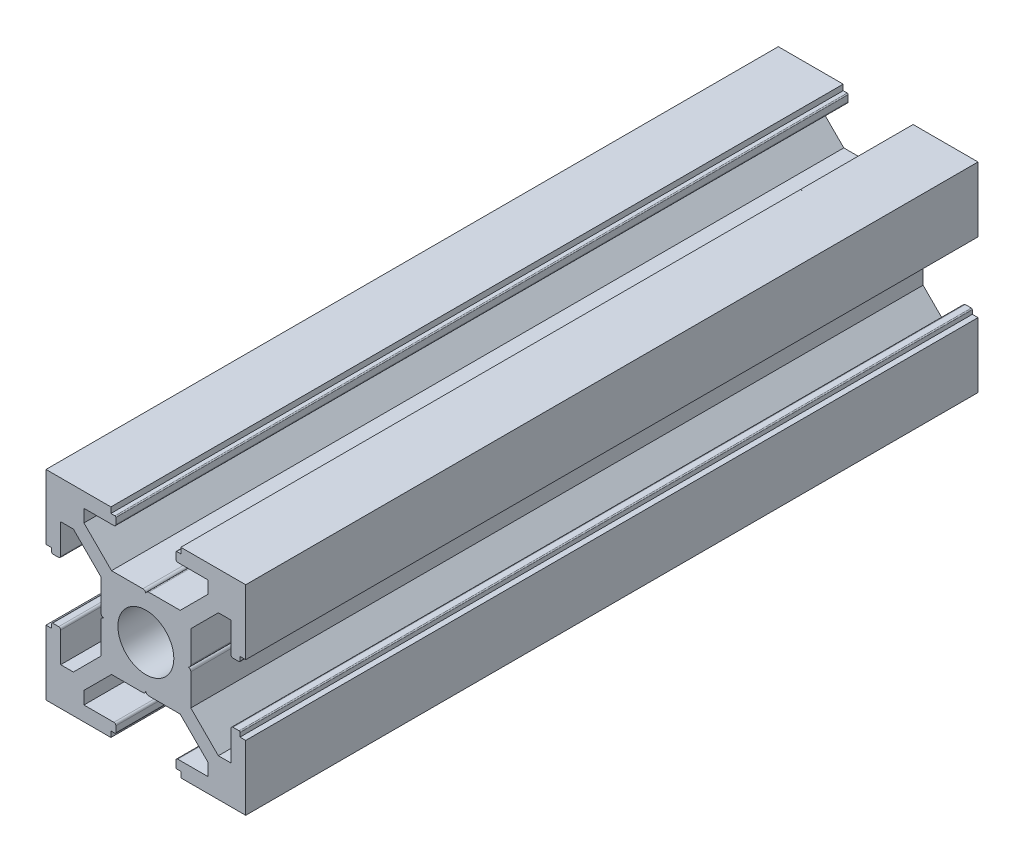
ISO-10303-21;
HEADER;
FILE_DESCRIPTION(('STEP AP214'),'2;1');
FILE_NAME('part.step','',(''),(''),'','','');
FILE_SCHEMA(('AUTOMOTIVE_DESIGN { 1 0 10303 214 1 1 1 1 }'));
ENDSEC;
DATA;
#1=APPLICATION_CONTEXT('core data for automotive mechanical design processes');
#2=APPLICATION_PROTOCOL_DEFINITION('international standard','automotive_design',2000,#1);
#3=PRODUCT_CONTEXT('',#1,'mechanical');
#4=PRODUCT('Part','Part','',(#3));
#5=PRODUCT_RELATED_PRODUCT_CATEGORY('part','',(#4));
#6=PRODUCT_DEFINITION_FORMATION('','',#4);
#7=PRODUCT_DEFINITION_CONTEXT('part definition',#1,'design');
#8=PRODUCT_DEFINITION('design','',#6,#7);
#9=PRODUCT_DEFINITION_SHAPE('','',#8);
#10=(LENGTH_UNIT() NAMED_UNIT(*) SI_UNIT(.MILLI.,.METRE.));
#11=(NAMED_UNIT(*) PLANE_ANGLE_UNIT() SI_UNIT($,.RADIAN.));
#12=(NAMED_UNIT(*) SI_UNIT($,.STERADIAN.) SOLID_ANGLE_UNIT());
#13=UNCERTAINTY_MEASURE_WITH_UNIT(LENGTH_MEASURE(1.E-05),#10,'distance_accuracy_value','');
#14=(GEOMETRIC_REPRESENTATION_CONTEXT(3) GLOBAL_UNCERTAINTY_ASSIGNED_CONTEXT((#13)) GLOBAL_UNIT_ASSIGNED_CONTEXT((#10,
#11,#12)) REPRESENTATION_CONTEXT('',''));
#15=CARTESIAN_POINT('',(0.,0.,0.));
#16=DIRECTION('',(0.,0.,1.));
#17=DIRECTION('',(1.,0.,0.));
#18=AXIS2_PLACEMENT_3D('',#15,#16,#17);
#19=CARTESIAN_POINT('',(0.45,-6.3,110.));
#20=DIRECTION('',(0.,0.,-1.));
#21=DIRECTION('',(-1.,0.,0.));
#22=AXIS2_PLACEMENT_3D('',#19,#20,#21);
#23=CYLINDRICAL_SURFACE('',#22,0.45);
#24=CARTESIAN_POINT('',(0.45,-6.3,0.));
#25=DIRECTION('',(0.,0.,1.));
#26=DIRECTION('',(1.,0.,0.));
#27=AXIS2_PLACEMENT_3D('',#24,#25,#26);
#28=CIRCLE('',#27,0.45);
#29=CARTESIAN_POINT('',(0.450000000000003,-6.75,0.));
#30=VERTEX_POINT('',#29);
#31=CARTESIAN_POINT('',(0.,-6.3,0.));
#32=VERTEX_POINT('',#31);
#33=EDGE_CURVE('E579',#30,#32,#28,.F.);
#34=ORIENTED_EDGE('',*,*,#33,.F.);
#35=DIRECTION('',(0.,0.,-1.));
#36=VECTOR('',#35,1.);
#37=CARTESIAN_POINT('',(0.450000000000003,-6.75,110.));
#38=LINE('',#37,#36);
#39=CARTESIAN_POINT('',(0.450000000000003,-6.75,110.));
#40=VERTEX_POINT('',#39);
#41=EDGE_CURVE('E11',#40,#30,#38,.T.);
#42=ORIENTED_EDGE('',*,*,#41,.F.);
#43=CARTESIAN_POINT('',(0.45,-6.3,110.));
#44=DIRECTION('',(0.,0.,1.));
#45=DIRECTION('',(1.,0.,0.));
#46=AXIS2_PLACEMENT_3D('',#43,#44,#45);
#47=CIRCLE('',#46,0.45);
#48=CARTESIAN_POINT('',(0.,-6.3,110.));
#49=VERTEX_POINT('',#48);
#50=EDGE_CURVE('E821',#40,#49,#47,.F.);
#51=ORIENTED_EDGE('',*,*,#50,.T.);
#52=DIRECTION('',(0.,0.,-1.));
#53=VECTOR('',#52,1.);
#54=CARTESIAN_POINT('',(0.,-6.3,110.));
#55=LINE('',#54,#53);
#56=EDGE_CURVE('E580',#49,#32,#55,.T.);
#57=ORIENTED_EDGE('',*,*,#56,.T.);
#58=EDGE_LOOP('',(#34,#42,#51,#57));
#59=FACE_BOUND('',#58,.T.);
#60=ADVANCED_FACE('F26',(#59),#23,.T.);
#61=CARTESIAN_POINT('',(0.,-6.75,110.));
#62=DIRECTION('',(0.,-1.,0.));
#63=DIRECTION('',(0.,0.,-1.));
#64=AXIS2_PLACEMENT_3D('',#61,#62,#63);
#65=PLANE('',#64);
#66=DIRECTION('',(-1.,0.,0.));
#67=VECTOR('',#66,1.);
#68=CARTESIAN_POINT('',(0.,-6.75,0.));
#69=LINE('',#68,#67);
#70=CARTESIAN_POINT('',(5.15900974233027,-6.75,0.));
#71=VERTEX_POINT('',#70);
#72=EDGE_CURVE('E572',#71,#30,#69,.T.);
#73=ORIENTED_EDGE('',*,*,#72,.F.);
#74=DIRECTION('',(0.,0.,-1.));
#75=VECTOR('',#74,1.);
#76=CARTESIAN_POINT('',(5.15900974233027,-6.75,110.));
#77=LINE('',#76,#75);
#78=CARTESIAN_POINT('',(5.15900974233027,-6.75,110.));
#79=VERTEX_POINT('',#78);
#80=EDGE_CURVE('E33',#79,#71,#77,.T.);
#81=ORIENTED_EDGE('',*,*,#80,.F.);
#82=DIRECTION('',(-1.,0.,0.));
#83=VECTOR('',#82,1.);
#84=CARTESIAN_POINT('',(0.,-6.75,110.));
#85=LINE('',#84,#83);
#86=EDGE_CURVE('E575',#79,#40,#85,.T.);
#87=ORIENTED_EDGE('',*,*,#86,.T.);
#88=ORIENTED_EDGE('',*,*,#41,.T.);
#89=EDGE_LOOP('',(#73,#81,#87,#88));
#90=FACE_BOUND('',#89,.T.);
#91=ADVANCED_FACE('F570',(#90),#65,.T.);
#92=CARTESIAN_POINT('',(15.7752155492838,-17.3662058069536,110.));
#93=DIRECTION('',(-0.707106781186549,-0.707106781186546,0.));
#94=DIRECTION('',(0.707106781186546,-0.707106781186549,0.));
#95=AXIS2_PLACEMENT_3D('',#92,#93,#94);
#96=PLANE('',#95);
#97=DIRECTION('',(-0.707106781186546,0.707106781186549,0.));
#98=VECTOR('',#97,1.);
#99=CARTESIAN_POINT('',(15.7752155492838,-17.3662058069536,0.));
#100=LINE('',#99,#98);
#101=CARTESIAN_POINT('',(9.3,-10.8909902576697,0.));
#102=VERTEX_POINT('',#101);
#103=EDGE_CURVE('E589',#102,#71,#100,.T.);
#104=ORIENTED_EDGE('',*,*,#103,.F.);
#105=DIRECTION('',(0.,0.,-1.));
#106=VECTOR('',#105,1.);
#107=CARTESIAN_POINT('',(9.3,-10.8909902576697,110.));
#108=LINE('',#107,#106);
#109=CARTESIAN_POINT('',(9.3,-10.8909902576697,110.));
#110=VERTEX_POINT('',#109);
#111=EDGE_CURVE('E1236',#110,#102,#108,.T.);
#112=ORIENTED_EDGE('',*,*,#111,.F.);
#113=DIRECTION('',(-0.707106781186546,0.707106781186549,0.));
#114=VECTOR('',#113,1.);
#115=CARTESIAN_POINT('',(15.7752155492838,-17.3662058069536,110.));
#116=LINE('',#115,#114);
#117=EDGE_CURVE('E824',#110,#79,#116,.T.);
#118=ORIENTED_EDGE('',*,*,#117,.T.);
#119=ORIENTED_EDGE('',*,*,#80,.T.);
#120=EDGE_LOOP('',(#104,#112,#118,#119));
#121=FACE_BOUND('',#120,.T.);
#122=ADVANCED_FACE('F1238',(#121),#96,.T.);
#123=CARTESIAN_POINT('',(9.3,-33.1414213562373,110.));
#124=DIRECTION('',(-1.,0.,0.));
#125=DIRECTION('',(0.,0.,1.));
#126=AXIS2_PLACEMENT_3D('',#123,#124,#125);
#127=PLANE('',#126);
#128=DIRECTION('',(0.,1.,0.));
#129=VECTOR('',#128,1.);
#130=CARTESIAN_POINT('',(9.3,-33.1414213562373,0.));
#131=LINE('',#130,#129);
#132=CARTESIAN_POINT('',(9.3,-12.795,0.));
#133=VERTEX_POINT('',#132);
#134=EDGE_CURVE('E591',#133,#102,#131,.T.);
#135=ORIENTED_EDGE('',*,*,#134,.F.);
#136=DIRECTION('',(0.,0.,-1.));
#137=VECTOR('',#136,1.);
#138=CARTESIAN_POINT('',(9.3,-12.795,110.));
#139=LINE('',#138,#137);
#140=CARTESIAN_POINT('',(9.3,-12.795,110.));
#141=VERTEX_POINT('',#140);
#142=EDGE_CURVE('E1234',#141,#133,#139,.T.);
#143=ORIENTED_EDGE('',*,*,#142,.F.);
#144=DIRECTION('',(0.,1.,0.));
#145=VECTOR('',#144,1.);
#146=CARTESIAN_POINT('',(9.3,-33.1414213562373,110.));
#147=LINE('',#146,#145);
#148=EDGE_CURVE('E827',#141,#110,#147,.T.);
#149=ORIENTED_EDGE('',*,*,#148,.T.);
#150=ORIENTED_EDGE('',*,*,#111,.T.);
#151=EDGE_LOOP('',(#135,#143,#149,#150));
#152=FACE_BOUND('',#151,.T.);
#153=ADVANCED_FACE('F1245',(#152),#127,.T.);
#154=CARTESIAN_POINT('',(0.,-12.795,110.));
#155=DIRECTION('',(0.,-1.,0.));
#156=DIRECTION('',(0.,0.,-1.));
#157=AXIS2_PLACEMENT_3D('',#154,#155,#156);
#158=PLANE('',#157);
#159=DIRECTION('',(-1.,0.,0.));
#160=VECTOR('',#159,1.);
#161=CARTESIAN_POINT('',(0.,-12.795,0.));
#162=LINE('',#161,#160);
#163=CARTESIAN_POINT('',(4.80000000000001,-12.795,0.));
#164=VERTEX_POINT('',#163);
#165=EDGE_CURVE('E595',#133,#164,#162,.T.);
#166=ORIENTED_EDGE('',*,*,#165,.T.);
#167=DIRECTION('',(0.,0.,-1.));
#168=VECTOR('',#167,1.);
#169=CARTESIAN_POINT('',(4.80000000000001,-12.795,110.));
#170=LINE('',#169,#168);
#171=CARTESIAN_POINT('',(4.80000000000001,-12.795,110.));
#172=VERTEX_POINT('',#171);
#173=EDGE_CURVE('E1231',#172,#164,#170,.T.);
#174=ORIENTED_EDGE('',*,*,#173,.F.);
#175=DIRECTION('',(-1.,0.,0.));
#176=VECTOR('',#175,1.);
#177=CARTESIAN_POINT('',(0.,-12.795,110.));
#178=LINE('',#177,#176);
#179=EDGE_CURVE('E830',#141,#172,#178,.T.);
#180=ORIENTED_EDGE('',*,*,#179,.F.);
#181=ORIENTED_EDGE('',*,*,#142,.T.);
#182=EDGE_LOOP('',(#166,#174,#180,#181));
#183=FACE_BOUND('',#182,.T.);
#184=ADVANCED_FACE('F1250',(#183),#158,.F.);
#185=CARTESIAN_POINT('',(4.8,-13.095,110.));
#186=DIRECTION('',(0.,0.,-1.));
#187=DIRECTION('',(-1.,0.,0.));
#188=AXIS2_PLACEMENT_3D('',#185,#186,#187);
#189=CYLINDRICAL_SURFACE('',#188,0.300000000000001);
#190=CARTESIAN_POINT('',(4.8,-13.095,0.));
#191=DIRECTION('',(0.,0.,1.));
#192=DIRECTION('',(1.,0.,0.));
#193=AXIS2_PLACEMENT_3D('',#190,#191,#192);
#194=CIRCLE('',#193,0.300000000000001);
#195=CARTESIAN_POINT('',(4.5,-13.095,0.));
#196=VERTEX_POINT('',#195);
#197=EDGE_CURVE('E597',#164,#196,#194,.T.);
#198=ORIENTED_EDGE('',*,*,#197,.T.);
#199=DIRECTION('',(0.,0.,-1.));
#200=VECTOR('',#199,1.);
#201=CARTESIAN_POINT('',(4.5,-13.095,110.));
#202=LINE('',#201,#200);
#203=CARTESIAN_POINT('',(4.5,-13.095,110.));
#204=VERTEX_POINT('',#203);
#205=EDGE_CURVE('E1228',#204,#196,#202,.T.);
#206=ORIENTED_EDGE('',*,*,#205,.F.);
#207=CARTESIAN_POINT('',(4.8,-13.095,110.));
#208=DIRECTION('',(0.,0.,1.));
#209=DIRECTION('',(1.,0.,0.));
#210=AXIS2_PLACEMENT_3D('',#207,#208,#209);
#211=CIRCLE('',#210,0.300000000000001);
#212=EDGE_CURVE('E832',#172,#204,#211,.T.);
#213=ORIENTED_EDGE('',*,*,#212,.F.);
#214=ORIENTED_EDGE('',*,*,#173,.T.);
#215=EDGE_LOOP('',(#198,#206,#213,#214));
#216=FACE_BOUND('',#215,.T.);
#217=ADVANCED_FACE('F1256',(#216),#189,.T.);
#218=CARTESIAN_POINT('',(4.5,-33.1414213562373,110.));
#219=DIRECTION('',(1.,0.,0.));
#220=DIRECTION('',(0.,0.,-1.));
#221=AXIS2_PLACEMENT_3D('',#218,#219,#220);
#222=PLANE('',#221);
#223=DIRECTION('',(0.,-1.,0.));
#224=VECTOR('',#223,1.);
#225=CARTESIAN_POINT('',(4.5,-33.1414213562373,0.));
#226=LINE('',#225,#224);
#227=CARTESIAN_POINT('',(4.5,-13.995,0.));
#228=VERTEX_POINT('',#227);
#229=EDGE_CURVE('E599',#196,#228,#226,.T.);
#230=ORIENTED_EDGE('',*,*,#229,.T.);
#231=DIRECTION('',(0.,0.,-1.));
#232=VECTOR('',#231,1.);
#233=CARTESIAN_POINT('',(4.5,-13.995,110.));
#234=LINE('',#233,#232);
#235=CARTESIAN_POINT('',(4.5,-13.995,110.));
#236=VERTEX_POINT('',#235);
#237=EDGE_CURVE('E1225',#236,#228,#234,.T.);
#238=ORIENTED_EDGE('',*,*,#237,.F.);
#239=DIRECTION('',(0.,-1.,0.));
#240=VECTOR('',#239,1.);
#241=CARTESIAN_POINT('',(4.5,-33.1414213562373,110.));
#242=LINE('',#241,#240);
#243=EDGE_CURVE('E834',#204,#236,#242,.T.);
#244=ORIENTED_EDGE('',*,*,#243,.F.);
#245=ORIENTED_EDGE('',*,*,#205,.T.);
#246=EDGE_LOOP('',(#230,#238,#244,#245));
#247=FACE_BOUND('',#246,.T.);
#248=ADVANCED_FACE('F1260',(#247),#222,.F.);
#249=CARTESIAN_POINT('',(4.65,-13.995,110.));
#250=DIRECTION('',(0.,0.,-1.));
#251=DIRECTION('',(-1.,0.,0.));
#252=AXIS2_PLACEMENT_3D('',#249,#250,#251);
#253=CYLINDRICAL_SURFACE('',#252,0.15);
#254=CARTESIAN_POINT('',(4.65,-13.995,0.));
#255=DIRECTION('',(0.,0.,1.));
#256=DIRECTION('',(1.,0.,0.));
#257=AXIS2_PLACEMENT_3D('',#254,#255,#256);
#258=CIRCLE('',#257,0.15);
#259=CARTESIAN_POINT('',(4.65,-14.145,0.));
#260=VERTEX_POINT('',#259);
#261=EDGE_CURVE('E601',#228,#260,#258,.T.);
#262=ORIENTED_EDGE('',*,*,#261,.T.);
#263=DIRECTION('',(0.,0.,-1.));
#264=VECTOR('',#263,1.);
#265=CARTESIAN_POINT('',(4.65,-14.145,110.));
#266=LINE('',#265,#264);
#267=CARTESIAN_POINT('',(4.65,-14.145,110.));
#268=VERTEX_POINT('',#267);
#269=EDGE_CURVE('E1222',#268,#260,#266,.T.);
#270=ORIENTED_EDGE('',*,*,#269,.F.);
#271=CARTESIAN_POINT('',(4.65,-13.995,110.));
#272=DIRECTION('',(0.,0.,1.));
#273=DIRECTION('',(1.,0.,0.));
#274=AXIS2_PLACEMENT_3D('',#271,#272,#273);
#275=CIRCLE('',#274,0.15);
#276=EDGE_CURVE('E836',#236,#268,#275,.T.);
#277=ORIENTED_EDGE('',*,*,#276,.F.);
#278=ORIENTED_EDGE('',*,*,#237,.T.);
#279=EDGE_LOOP('',(#262,#270,#277,#278));
#280=FACE_BOUND('',#279,.T.);
#281=ADVANCED_FACE('F1265',(#280),#253,.T.);
#282=CARTESIAN_POINT('',(0.,-14.145,110.));
#283=DIRECTION('',(0.,1.,0.));
#284=DIRECTION('',(0.,0.,1.));
#285=AXIS2_PLACEMENT_3D('',#282,#283,#284);
#286=PLANE('',#285);
#287=DIRECTION('',(1.,0.,0.));
#288=VECTOR('',#287,1.);
#289=CARTESIAN_POINT('',(0.,-14.145,0.));
#290=LINE('',#289,#288);
#291=CARTESIAN_POINT('',(5.25,-14.145,0.));
#292=VERTEX_POINT('',#291);
#293=EDGE_CURVE('E603',#260,#292,#290,.T.);
#294=ORIENTED_EDGE('',*,*,#293,.T.);
#295=DIRECTION('',(0.,0.,-1.));
#296=VECTOR('',#295,1.);
#297=CARTESIAN_POINT('',(5.25,-14.145,110.));
#298=LINE('',#297,#296);
#299=CARTESIAN_POINT('',(5.25,-14.145,110.));
#300=VERTEX_POINT('',#299);
#301=EDGE_CURVE('E1219',#300,#292,#298,.T.);
#302=ORIENTED_EDGE('',*,*,#301,.F.);
#303=DIRECTION('',(1.,0.,0.));
#304=VECTOR('',#303,1.);
#305=CARTESIAN_POINT('',(0.,-14.145,110.));
#306=LINE('',#305,#304);
#307=EDGE_CURVE('E838',#268,#300,#306,.T.);
#308=ORIENTED_EDGE('',*,*,#307,.F.);
#309=ORIENTED_EDGE('',*,*,#269,.T.);
#310=EDGE_LOOP('',(#294,#302,#308,#309));
#311=FACE_BOUND('',#310,.T.);
#312=ADVANCED_FACE('F1272',(#311),#286,.F.);
#313=CARTESIAN_POINT('',(5.25,-33.1414213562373,110.));
#314=DIRECTION('',(1.,0.,0.));
#315=DIRECTION('',(0.,0.,-1.));
#316=AXIS2_PLACEMENT_3D('',#313,#314,#315);
#317=PLANE('',#316);
#318=DIRECTION('',(0.,-1.,0.));
#319=VECTOR('',#318,1.);
#320=CARTESIAN_POINT('',(5.25,-33.1414213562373,0.));
#321=LINE('',#320,#319);
#322=CARTESIAN_POINT('',(5.25,-15.,0.));
#323=VERTEX_POINT('',#322);
#324=EDGE_CURVE('E605',#292,#323,#321,.T.);
#325=ORIENTED_EDGE('',*,*,#324,.T.);
#326=DIRECTION('',(0.,0.,-1.));
#327=VECTOR('',#326,1.);
#328=CARTESIAN_POINT('',(5.25,-15.,110.));
#329=LINE('',#328,#327);
#330=CARTESIAN_POINT('',(5.25,-15.,110.));
#331=VERTEX_POINT('',#330);
#332=EDGE_CURVE('E1217',#331,#323,#329,.T.);
#333=ORIENTED_EDGE('',*,*,#332,.F.);
#334=DIRECTION('',(0.,-1.,0.));
#335=VECTOR('',#334,1.);
#336=CARTESIAN_POINT('',(5.25,-33.1414213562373,110.));
#337=LINE('',#336,#335);
#338=EDGE_CURVE('E840',#300,#331,#337,.T.);
#339=ORIENTED_EDGE('',*,*,#338,.F.);
#340=ORIENTED_EDGE('',*,*,#301,.T.);
#341=EDGE_LOOP('',(#325,#333,#339,#340));
#342=FACE_BOUND('',#341,.T.);
#343=ADVANCED_FACE('F1276',(#342),#317,.F.);
#344=CARTESIAN_POINT('',(0.,-15.,110.));
#345=DIRECTION('',(0.,-1.,0.));
#346=DIRECTION('',(0.,0.,-1.));
#347=AXIS2_PLACEMENT_3D('',#344,#345,#346);
#348=PLANE('',#347);
#349=DIRECTION('',(-1.,0.,0.));
#350=VECTOR('',#349,1.);
#351=CARTESIAN_POINT('',(0.,-15.,0.));
#352=LINE('',#351,#350);
#353=CARTESIAN_POINT('',(15.,-15.,0.));
#354=VERTEX_POINT('',#353);
#355=EDGE_CURVE('E608',#354,#323,#352,.T.);
#356=ORIENTED_EDGE('',*,*,#355,.F.);
#357=DIRECTION('',(0.,0.,-1.));
#358=VECTOR('',#357,1.);
#359=CARTESIAN_POINT('',(15.,-15.,110.));
#360=LINE('',#359,#358);
#361=CARTESIAN_POINT('',(15.,-15.,110.));
#362=VERTEX_POINT('',#361);
#363=EDGE_CURVE('E1215',#362,#354,#360,.T.);
#364=ORIENTED_EDGE('',*,*,#363,.F.);
#365=DIRECTION('',(-1.,0.,0.));
#366=VECTOR('',#365,1.);
#367=CARTESIAN_POINT('',(0.,-15.,110.));
#368=LINE('',#367,#366);
#369=EDGE_CURVE('E842',#362,#331,#368,.T.);
#370=ORIENTED_EDGE('',*,*,#369,.T.);
#371=ORIENTED_EDGE('',*,*,#332,.T.);
#372=EDGE_LOOP('',(#356,#364,#370,#371));
#373=FACE_BOUND('',#372,.T.);
#374=ADVANCED_FACE('F1279',(#373),#348,.T.);
#375=CARTESIAN_POINT('',(15.,-33.1414213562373,110.));
#376=DIRECTION('',(-1.,0.,0.));
#377=DIRECTION('',(0.,-1.,0.));
#378=AXIS2_PLACEMENT_3D('',#375,#376,#377);
#379=PLANE('',#378);
#380=DIRECTION('',(0.,1.,0.));
#381=VECTOR('',#380,1.);
#382=CARTESIAN_POINT('',(15.,-33.1414213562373,0.));
#383=LINE('',#382,#381);
#384=CARTESIAN_POINT('',(15.,-5.25000000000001,0.));
#385=VERTEX_POINT('',#384);
#386=EDGE_CURVE('E611',#354,#385,#383,.T.);
#387=ORIENTED_EDGE('',*,*,#386,.T.);
#388=DIRECTION('',(0.,0.,-1.));
#389=VECTOR('',#388,1.);
#390=CARTESIAN_POINT('',(15.,-5.25000000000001,110.));
#391=LINE('',#390,#389);
#392=CARTESIAN_POINT('',(15.,-5.25000000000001,110.));
#393=VERTEX_POINT('',#392);
#394=EDGE_CURVE('E1213',#393,#385,#391,.T.);
#395=ORIENTED_EDGE('',*,*,#394,.F.);
#396=DIRECTION('',(0.,1.,0.));
#397=VECTOR('',#396,1.);
#398=CARTESIAN_POINT('',(15.,-33.1414213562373,110.));
#399=LINE('',#398,#397);
#400=EDGE_CURVE('E845',#362,#393,#399,.T.);
#401=ORIENTED_EDGE('',*,*,#400,.F.);
#402=ORIENTED_EDGE('',*,*,#363,.T.);
#403=EDGE_LOOP('',(#387,#395,#401,#402));
#404=FACE_BOUND('',#403,.T.);
#405=ADVANCED_FACE('F1285',(#404),#379,.F.);
#406=CARTESIAN_POINT('',(0.,-5.24999999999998,110.));
#407=DIRECTION('',(0.,1.,0.));
#408=DIRECTION('',(-1.,0.,0.));
#409=AXIS2_PLACEMENT_3D('',#406,#407,#408);
#410=PLANE('',#409);
#411=DIRECTION('',(1.,0.,0.));
#412=VECTOR('',#411,1.);
#413=CARTESIAN_POINT('',(0.,-5.24999999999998,0.));
#414=LINE('',#413,#412);
#415=CARTESIAN_POINT('',(14.145,-5.25,0.));
#416=VERTEX_POINT('',#415);
#417=EDGE_CURVE('E614',#416,#385,#414,.T.);
#418=ORIENTED_EDGE('',*,*,#417,.F.);
#419=DIRECTION('',(0.,0.,-1.));
#420=VECTOR('',#419,1.);
#421=CARTESIAN_POINT('',(14.145,-5.25,110.));
#422=LINE('',#421,#420);
#423=CARTESIAN_POINT('',(14.145,-5.25,110.));
#424=VERTEX_POINT('',#423);
#425=EDGE_CURVE('E1211',#424,#416,#422,.T.);
#426=ORIENTED_EDGE('',*,*,#425,.F.);
#427=DIRECTION('',(1.,0.,0.));
#428=VECTOR('',#427,1.);
#429=CARTESIAN_POINT('',(0.,-5.24999999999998,110.));
#430=LINE('',#429,#428);
#431=EDGE_CURVE('E847',#424,#393,#430,.T.);
#432=ORIENTED_EDGE('',*,*,#431,.T.);
#433=ORIENTED_EDGE('',*,*,#394,.T.);
#434=EDGE_LOOP('',(#418,#426,#432,#433));
#435=FACE_BOUND('',#434,.T.);
#436=ADVANCED_FACE('F1289',(#435),#410,.T.);
#437=CARTESIAN_POINT('',(14.145,-33.1414213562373,110.));
#438=DIRECTION('',(1.,0.,0.));
#439=DIRECTION('',(0.,0.,-1.));
#440=AXIS2_PLACEMENT_3D('',#437,#438,#439);
#441=PLANE('',#440);
#442=DIRECTION('',(0.,-1.,0.));
#443=VECTOR('',#442,1.);
#444=CARTESIAN_POINT('',(14.145,-33.1414213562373,0.));
#445=LINE('',#444,#443);
#446=CARTESIAN_POINT('',(14.145,-4.65000000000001,0.));
#447=VERTEX_POINT('',#446);
#448=EDGE_CURVE('E617',#447,#416,#445,.T.);
#449=ORIENTED_EDGE('',*,*,#448,.F.);
#450=DIRECTION('',(0.,0.,-1.));
#451=VECTOR('',#450,1.);
#452=CARTESIAN_POINT('',(14.145,-4.65000000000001,110.));
#453=LINE('',#452,#451);
#454=CARTESIAN_POINT('',(14.145,-4.65000000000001,110.));
#455=VERTEX_POINT('',#454);
#456=EDGE_CURVE('E1209',#455,#447,#453,.T.);
#457=ORIENTED_EDGE('',*,*,#456,.F.);
#458=DIRECTION('',(0.,-1.,0.));
#459=VECTOR('',#458,1.);
#460=CARTESIAN_POINT('',(14.145,-33.1414213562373,110.));
#461=LINE('',#460,#459);
#462=EDGE_CURVE('E850',#455,#424,#461,.T.);
#463=ORIENTED_EDGE('',*,*,#462,.T.);
#464=ORIENTED_EDGE('',*,*,#425,.T.);
#465=EDGE_LOOP('',(#449,#457,#463,#464));
#466=FACE_BOUND('',#465,.T.);
#467=ADVANCED_FACE('F1292',(#466),#441,.T.);
#468=CARTESIAN_POINT('',(13.995,-4.65,110.));
#469=DIRECTION('',(0.,0.,-1.));
#470=DIRECTION('',(-1.,0.,0.));
#471=AXIS2_PLACEMENT_3D('',#468,#469,#470);
#472=CYLINDRICAL_SURFACE('',#471,0.15);
#473=CARTESIAN_POINT('',(13.995,-4.65,0.));
#474=DIRECTION('',(0.,0.,1.));
#475=DIRECTION('',(1.,0.,0.));
#476=AXIS2_PLACEMENT_3D('',#473,#474,#475);
#477=CIRCLE('',#476,0.15);
#478=CARTESIAN_POINT('',(13.995,-4.5,0.));
#479=VERTEX_POINT('',#478);
#480=EDGE_CURVE('E620',#479,#447,#477,.F.);
#481=ORIENTED_EDGE('',*,*,#480,.F.);
#482=DIRECTION('',(0.,0.,-1.));
#483=VECTOR('',#482,1.);
#484=CARTESIAN_POINT('',(13.995,-4.5,110.));
#485=LINE('',#484,#483);
#486=CARTESIAN_POINT('',(13.995,-4.5,110.));
#487=VERTEX_POINT('',#486);
#488=EDGE_CURVE('E1207',#487,#479,#485,.T.);
#489=ORIENTED_EDGE('',*,*,#488,.F.);
#490=CARTESIAN_POINT('',(13.995,-4.65,110.));
#491=DIRECTION('',(0.,0.,1.));
#492=DIRECTION('',(1.,0.,0.));
#493=AXIS2_PLACEMENT_3D('',#490,#491,#492);
#494=CIRCLE('',#493,0.15);
#495=EDGE_CURVE('E853',#487,#455,#494,.F.);
#496=ORIENTED_EDGE('',*,*,#495,.T.);
#497=ORIENTED_EDGE('',*,*,#456,.T.);
#498=EDGE_LOOP('',(#481,#489,#496,#497));
#499=FACE_BOUND('',#498,.T.);
#500=ADVANCED_FACE('F1297',(#499),#472,.T.);
#501=CARTESIAN_POINT('',(0.,-4.5,110.));
#502=DIRECTION('',(0.,1.,0.));
#503=DIRECTION('',(0.,0.,1.));
#504=AXIS2_PLACEMENT_3D('',#501,#502,#503);
#505=PLANE('',#504);
#506=DIRECTION('',(1.,0.,0.));
#507=VECTOR('',#506,1.);
#508=CARTESIAN_POINT('',(0.,-4.5,0.));
#509=LINE('',#508,#507);
#510=CARTESIAN_POINT('',(13.095,-4.5,0.));
#511=VERTEX_POINT('',#510);
#512=EDGE_CURVE('E623',#511,#479,#509,.T.);
#513=ORIENTED_EDGE('',*,*,#512,.F.);
#514=DIRECTION('',(0.,0.,-1.));
#515=VECTOR('',#514,1.);
#516=CARTESIAN_POINT('',(13.095,-4.5,110.));
#517=LINE('',#516,#515);
#518=CARTESIAN_POINT('',(13.095,-4.5,110.));
#519=VERTEX_POINT('',#518);
#520=EDGE_CURVE('E1205',#519,#511,#517,.T.);
#521=ORIENTED_EDGE('',*,*,#520,.F.);
#522=DIRECTION('',(1.,0.,0.));
#523=VECTOR('',#522,1.);
#524=CARTESIAN_POINT('',(0.,-4.5,110.));
#525=LINE('',#524,#523);
#526=EDGE_CURVE('E856',#519,#487,#525,.T.);
#527=ORIENTED_EDGE('',*,*,#526,.T.);
#528=ORIENTED_EDGE('',*,*,#488,.T.);
#529=EDGE_LOOP('',(#513,#521,#527,#528));
#530=FACE_BOUND('',#529,.T.);
#531=ADVANCED_FACE('F1300',(#530),#505,.T.);
#532=CARTESIAN_POINT('',(13.095,-4.80000000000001,110.));
#533=DIRECTION('',(0.,0.,-1.));
#534=DIRECTION('',(-1.,0.,0.));
#535=AXIS2_PLACEMENT_3D('',#532,#533,#534);
#536=CYLINDRICAL_SURFACE('',#535,0.300000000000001);
#537=CARTESIAN_POINT('',(13.095,-4.80000000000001,0.));
#538=DIRECTION('',(0.,0.,1.));
#539=DIRECTION('',(1.,0.,0.));
#540=AXIS2_PLACEMENT_3D('',#537,#538,#539);
#541=CIRCLE('',#540,0.300000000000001);
#542=CARTESIAN_POINT('',(12.795,-4.80000000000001,0.));
#543=VERTEX_POINT('',#542);
#544=EDGE_CURVE('E626',#543,#511,#541,.F.);
#545=ORIENTED_EDGE('',*,*,#544,.F.);
#546=DIRECTION('',(0.,0.,-1.));
#547=VECTOR('',#546,1.);
#548=CARTESIAN_POINT('',(12.795,-4.80000000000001,110.));
#549=LINE('',#548,#547);
#550=CARTESIAN_POINT('',(12.795,-4.80000000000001,110.));
#551=VERTEX_POINT('',#550);
#552=EDGE_CURVE('E1203',#551,#543,#549,.T.);
#553=ORIENTED_EDGE('',*,*,#552,.F.);
#554=CARTESIAN_POINT('',(13.095,-4.80000000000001,110.));
#555=DIRECTION('',(0.,0.,1.));
#556=DIRECTION('',(1.,0.,0.));
#557=AXIS2_PLACEMENT_3D('',#554,#555,#556);
#558=CIRCLE('',#557,0.300000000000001);
#559=EDGE_CURVE('E859',#551,#519,#558,.F.);
#560=ORIENTED_EDGE('',*,*,#559,.T.);
#561=ORIENTED_EDGE('',*,*,#520,.T.);
#562=EDGE_LOOP('',(#545,#553,#560,#561));
#563=FACE_BOUND('',#562,.T.);
#564=ADVANCED_FACE('F1305',(#563),#536,.T.);
#565=CARTESIAN_POINT('',(12.795,-33.1414213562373,110.));
#566=DIRECTION('',(-1.,0.,0.));
#567=DIRECTION('',(0.,-1.,0.));
#568=AXIS2_PLACEMENT_3D('',#565,#566,#567);
#569=PLANE('',#568);
#570=DIRECTION('',(0.,1.,0.));
#571=VECTOR('',#570,1.);
#572=CARTESIAN_POINT('',(12.795,-33.1414213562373,0.));
#573=LINE('',#572,#571);
#574=CARTESIAN_POINT('',(12.795,-9.3,0.));
#575=VERTEX_POINT('',#574);
#576=EDGE_CURVE('E629',#575,#543,#573,.T.);
#577=ORIENTED_EDGE('',*,*,#576,.F.);
#578=DIRECTION('',(0.,0.,-1.));
#579=VECTOR('',#578,1.);
#580=CARTESIAN_POINT('',(12.795,-9.3,110.));
#581=LINE('',#580,#579);
#582=CARTESIAN_POINT('',(12.795,-9.3,110.));
#583=VERTEX_POINT('',#582);
#584=EDGE_CURVE('E1201',#583,#575,#581,.T.);
#585=ORIENTED_EDGE('',*,*,#584,.F.);
#586=DIRECTION('',(0.,1.,0.));
#587=VECTOR('',#586,1.);
#588=CARTESIAN_POINT('',(12.795,-33.1414213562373,110.));
#589=LINE('',#588,#587);
#590=EDGE_CURVE('E862',#583,#551,#589,.T.);
#591=ORIENTED_EDGE('',*,*,#590,.T.);
#592=ORIENTED_EDGE('',*,*,#552,.T.);
#593=EDGE_LOOP('',(#577,#585,#591,#592));
#594=FACE_BOUND('',#593,.T.);
#595=ADVANCED_FACE('F1308',(#594),#569,.T.);
#596=CARTESIAN_POINT('',(0.,-9.3,110.));
#597=DIRECTION('',(0.,-1.,0.));
#598=DIRECTION('',(0.,0.,-1.));
#599=AXIS2_PLACEMENT_3D('',#596,#597,#598);
#600=PLANE('',#599);
#601=DIRECTION('',(-1.,0.,0.));
#602=VECTOR('',#601,1.);
#603=CARTESIAN_POINT('',(0.,-9.3,0.));
#604=LINE('',#603,#602);
#605=CARTESIAN_POINT('',(10.8909902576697,-9.3,0.));
#606=VERTEX_POINT('',#605);
#607=EDGE_CURVE('E632',#575,#606,#604,.T.);
#608=ORIENTED_EDGE('',*,*,#607,.T.);
#609=DIRECTION('',(0.,0.,-1.));
#610=VECTOR('',#609,1.);
#611=CARTESIAN_POINT('',(10.8909902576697,-9.3,110.));
#612=LINE('',#611,#610);
#613=CARTESIAN_POINT('',(10.8909902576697,-9.3,110.));
#614=VERTEX_POINT('',#613);
#615=EDGE_CURVE('E1198',#614,#606,#612,.T.);
#616=ORIENTED_EDGE('',*,*,#615,.F.);
#617=DIRECTION('',(-1.,0.,0.));
#618=VECTOR('',#617,1.);
#619=CARTESIAN_POINT('',(0.,-9.3,110.));
#620=LINE('',#619,#618);
#621=EDGE_CURVE('E865',#583,#614,#620,.T.);
#622=ORIENTED_EDGE('',*,*,#621,.F.);
#623=ORIENTED_EDGE('',*,*,#584,.T.);
#624=EDGE_LOOP('',(#608,#616,#622,#623));
#625=FACE_BOUND('',#624,.T.);
#626=ADVANCED_FACE('F1315',(#625),#600,.F.);
#627=CARTESIAN_POINT('',(17.3662058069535,-15.7752155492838,110.));
#628=DIRECTION('',(-0.707106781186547,-0.707106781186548,0.));
#629=DIRECTION('',(0.707106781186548,-0.707106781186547,0.));
#630=AXIS2_PLACEMENT_3D('',#627,#628,#629);
#631=PLANE('',#630);
#632=DIRECTION('',(-0.707106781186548,0.707106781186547,0.));
#633=VECTOR('',#632,1.);
#634=CARTESIAN_POINT('',(17.3662058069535,-15.7752155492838,0.));
#635=LINE('',#634,#633);
#636=CARTESIAN_POINT('',(6.75,-5.15900974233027,0.));
#637=VERTEX_POINT('',#636);
#638=EDGE_CURVE('E634',#606,#637,#635,.T.);
#639=ORIENTED_EDGE('',*,*,#638,.T.);
#640=DIRECTION('',(0.,0.,-1.));
#641=VECTOR('',#640,1.);
#642=CARTESIAN_POINT('',(6.75,-5.15900974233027,110.));
#643=LINE('',#642,#641);
#644=CARTESIAN_POINT('',(6.75,-5.15900974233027,110.));
#645=VERTEX_POINT('',#644);
#646=EDGE_CURVE('E1196',#645,#637,#643,.T.);
#647=ORIENTED_EDGE('',*,*,#646,.F.);
#648=DIRECTION('',(-0.707106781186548,0.707106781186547,0.));
#649=VECTOR('',#648,1.);
#650=CARTESIAN_POINT('',(17.3662058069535,-15.7752155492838,110.));
#651=LINE('',#650,#649);
#652=EDGE_CURVE('E867',#614,#645,#651,.T.);
#653=ORIENTED_EDGE('',*,*,#652,.F.);
#654=ORIENTED_EDGE('',*,*,#615,.T.);
#655=EDGE_LOOP('',(#639,#647,#653,#654));
#656=FACE_BOUND('',#655,.T.);
#657=ADVANCED_FACE('F1319',(#656),#631,.F.);
#658=CARTESIAN_POINT('',(6.75,-33.1414213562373,110.));
#659=DIRECTION('',(1.,0.,0.));
#660=DIRECTION('',(0.,0.,-1.));
#661=AXIS2_PLACEMENT_3D('',#658,#659,#660);
#662=PLANE('',#661);
#663=DIRECTION('',(0.,-1.,0.));
#664=VECTOR('',#663,1.);
#665=CARTESIAN_POINT('',(6.75,-33.1414213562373,0.));
#666=LINE('',#665,#664);
#667=CARTESIAN_POINT('',(6.75,-0.450000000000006,0.));
#668=VERTEX_POINT('',#667);
#669=EDGE_CURVE('E637',#668,#637,#666,.T.);
#670=ORIENTED_EDGE('',*,*,#669,.F.);
#671=DIRECTION('',(0.,0.,-1.));
#672=VECTOR('',#671,1.);
#673=CARTESIAN_POINT('',(6.75,-0.450000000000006,110.));
#674=LINE('',#673,#672);
#675=CARTESIAN_POINT('',(6.75,-0.450000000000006,110.));
#676=VERTEX_POINT('',#675);
#677=EDGE_CURVE('E1194',#676,#668,#674,.T.);
#678=ORIENTED_EDGE('',*,*,#677,.F.);
#679=DIRECTION('',(0.,-1.,0.));
#680=VECTOR('',#679,1.);
#681=CARTESIAN_POINT('',(6.75,-33.1414213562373,110.));
#682=LINE('',#681,#680);
#683=EDGE_CURVE('E869',#676,#645,#682,.T.);
#684=ORIENTED_EDGE('',*,*,#683,.T.);
#685=ORIENTED_EDGE('',*,*,#646,.T.);
#686=EDGE_LOOP('',(#670,#678,#684,#685));
#687=FACE_BOUND('',#686,.T.);
#688=ADVANCED_FACE('F1322',(#687),#662,.T.);
#689=CARTESIAN_POINT('',(6.3,-0.45,110.));
#690=DIRECTION('',(0.,0.,-1.));
#691=DIRECTION('',(-1.,0.,0.));
#692=AXIS2_PLACEMENT_3D('',#689,#690,#691);
#693=CYLINDRICAL_SURFACE('',#692,0.45);
#694=CARTESIAN_POINT('',(6.3,-0.45,0.));
#695=DIRECTION('',(0.,0.,1.));
#696=DIRECTION('',(1.,0.,0.));
#697=AXIS2_PLACEMENT_3D('',#694,#695,#696);
#698=CIRCLE('',#697,0.45);
#699=CARTESIAN_POINT('',(6.3,0.,0.));
#700=VERTEX_POINT('',#699);
#701=EDGE_CURVE('E640',#668,#700,#698,.T.);
#702=ORIENTED_EDGE('',*,*,#701,.T.);
#703=DIRECTION('',(0.,0.,-1.));
#704=VECTOR('',#703,1.);
#705=CARTESIAN_POINT('',(6.3,0.,110.));
#706=LINE('',#705,#704);
#707=CARTESIAN_POINT('',(6.3,0.,110.));
#708=VERTEX_POINT('',#707);
#709=EDGE_CURVE('E1192',#708,#700,#706,.T.);
#710=ORIENTED_EDGE('',*,*,#709,.F.);
#711=CARTESIAN_POINT('',(6.3,-0.45,110.));
#712=DIRECTION('',(0.,0.,1.));
#713=DIRECTION('',(1.,0.,0.));
#714=AXIS2_PLACEMENT_3D('',#711,#712,#713);
#715=CIRCLE('',#714,0.45);
#716=EDGE_CURVE('E872',#676,#708,#715,.T.);
#717=ORIENTED_EDGE('',*,*,#716,.F.);
#718=ORIENTED_EDGE('',*,*,#677,.T.);
#719=EDGE_LOOP('',(#702,#710,#717,#718));
#720=FACE_BOUND('',#719,.T.);
#721=ADVANCED_FACE('F1327',(#720),#693,.T.);
#722=CARTESIAN_POINT('',(6.3,0.45,110.));
#723=DIRECTION('',(0.,0.,-1.));
#724=DIRECTION('',(-1.,0.,0.));
#725=AXIS2_PLACEMENT_3D('',#722,#723,#724);
#726=CYLINDRICAL_SURFACE('',#725,0.45);
#727=CARTESIAN_POINT('',(6.3,0.45,0.));
#728=DIRECTION('',(0.,0.,1.));
#729=DIRECTION('',(1.,0.,0.));
#730=AXIS2_PLACEMENT_3D('',#727,#728,#729);
#731=CIRCLE('',#730,0.45);
#732=CARTESIAN_POINT('',(6.75,0.450000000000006,0.));
#733=VERTEX_POINT('',#732);
#734=EDGE_CURVE('E643',#733,#700,#731,.F.);
#735=ORIENTED_EDGE('',*,*,#734,.F.);
#736=DIRECTION('',(0.,0.,-1.));
#737=VECTOR('',#736,1.);
#738=CARTESIAN_POINT('',(6.75,0.450000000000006,110.));
#739=LINE('',#738,#737);
#740=CARTESIAN_POINT('',(6.75,0.450000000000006,110.));
#741=VERTEX_POINT('',#740);
#742=EDGE_CURVE('E1190',#741,#733,#739,.T.);
#743=ORIENTED_EDGE('',*,*,#742,.F.);
#744=CARTESIAN_POINT('',(6.3,0.45,110.));
#745=DIRECTION('',(0.,0.,1.));
#746=DIRECTION('',(1.,0.,0.));
#747=AXIS2_PLACEMENT_3D('',#744,#745,#746);
#748=CIRCLE('',#747,0.45);
#749=EDGE_CURVE('E874',#741,#708,#748,.F.);
#750=ORIENTED_EDGE('',*,*,#749,.T.);
#751=ORIENTED_EDGE('',*,*,#709,.T.);
#752=EDGE_LOOP('',(#735,#743,#750,#751));
#753=FACE_BOUND('',#752,.T.);
#754=ADVANCED_FACE('F1331',(#753),#726,.T.);
#755=CARTESIAN_POINT('',(6.75,-33.1414213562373,110.));
#756=DIRECTION('',(-1.,0.,0.));
#757=DIRECTION('',(0.,0.,1.));
#758=AXIS2_PLACEMENT_3D('',#755,#756,#757);
#759=PLANE('',#758);
#760=DIRECTION('',(0.,1.,0.));
#761=VECTOR('',#760,1.);
#762=CARTESIAN_POINT('',(6.75,-33.1414213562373,0.));
#763=LINE('',#762,#761);
#764=CARTESIAN_POINT('',(6.75,5.15900974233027,0.));
#765=VERTEX_POINT('',#764);
#766=EDGE_CURVE('E646',#733,#765,#763,.T.);
#767=ORIENTED_EDGE('',*,*,#766,.T.);
#768=DIRECTION('',(0.,0.,-1.));
#769=VECTOR('',#768,1.);
#770=CARTESIAN_POINT('',(6.75,5.15900974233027,110.));
#771=LINE('',#770,#769);
#772=CARTESIAN_POINT('',(6.75,5.15900974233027,110.));
#773=VERTEX_POINT('',#772);
#774=EDGE_CURVE('E1188',#773,#765,#771,.T.);
#775=ORIENTED_EDGE('',*,*,#774,.F.);
#776=DIRECTION('',(0.,1.,0.));
#777=VECTOR('',#776,1.);
#778=CARTESIAN_POINT('',(6.75,-33.1414213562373,110.));
#779=LINE('',#778,#777);
#780=EDGE_CURVE('E877',#741,#773,#779,.T.);
#781=ORIENTED_EDGE('',*,*,#780,.F.);
#782=ORIENTED_EDGE('',*,*,#742,.T.);
#783=EDGE_LOOP('',(#767,#775,#781,#782));
#784=FACE_BOUND('',#783,.T.);
#785=ADVANCED_FACE('F1336',(#784),#759,.F.);
#786=CARTESIAN_POINT('',(-15.7752155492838,-17.3662058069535,110.));
#787=DIRECTION('',(0.707106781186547,-0.707106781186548,0.));
#788=DIRECTION('',(0.707106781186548,0.707106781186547,0.));
#789=AXIS2_PLACEMENT_3D('',#786,#787,#788);
#790=PLANE('',#789);
#791=DIRECTION('',(-0.707106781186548,-0.707106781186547,0.));
#792=VECTOR('',#791,1.);
#793=CARTESIAN_POINT('',(-15.7752155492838,-17.3662058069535,0.));
#794=LINE('',#793,#792);
#795=CARTESIAN_POINT('',(10.8909902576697,9.3,0.));
#796=VERTEX_POINT('',#795);
#797=EDGE_CURVE('E649',#796,#765,#794,.T.);
#798=ORIENTED_EDGE('',*,*,#797,.F.);
#799=DIRECTION('',(0.,0.,-1.));
#800=VECTOR('',#799,1.);
#801=CARTESIAN_POINT('',(10.8909902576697,9.3,110.));
#802=LINE('',#801,#800);
#803=CARTESIAN_POINT('',(10.8909902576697,9.3,110.));
#804=VERTEX_POINT('',#803);
#805=EDGE_CURVE('E1186',#804,#796,#802,.T.);
#806=ORIENTED_EDGE('',*,*,#805,.F.);
#807=DIRECTION('',(-0.707106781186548,-0.707106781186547,0.));
#808=VECTOR('',#807,1.);
#809=CARTESIAN_POINT('',(-15.7752155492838,-17.3662058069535,110.));
#810=LINE('',#809,#808);
#811=EDGE_CURVE('E879',#804,#773,#810,.T.);
#812=ORIENTED_EDGE('',*,*,#811,.T.);
#813=ORIENTED_EDGE('',*,*,#774,.T.);
#814=EDGE_LOOP('',(#798,#806,#812,#813));
#815=FACE_BOUND('',#814,.T.);
#816=ADVANCED_FACE('F1620',(#815),#790,.T.);
#817=CARTESIAN_POINT('',(0.,9.3,110.));
#818=DIRECTION('',(0.,-1.,0.));
#819=DIRECTION('',(0.,0.,-1.));
#820=AXIS2_PLACEMENT_3D('',#817,#818,#819);
#821=PLANE('',#820);
#822=DIRECTION('',(-1.,0.,0.));
#823=VECTOR('',#822,1.);
#824=CARTESIAN_POINT('',(0.,9.3,0.));
#825=LINE('',#824,#823);
#826=CARTESIAN_POINT('',(12.795,9.3,0.));
#827=VERTEX_POINT('',#826);
#828=EDGE_CURVE('E652',#827,#796,#825,.T.);
#829=ORIENTED_EDGE('',*,*,#828,.F.);
#830=DIRECTION('',(0.,0.,-1.));
#831=VECTOR('',#830,1.);
#832=CARTESIAN_POINT('',(12.795,9.3,110.));
#833=LINE('',#832,#831);
#834=CARTESIAN_POINT('',(12.795,9.3,110.));
#835=VERTEX_POINT('',#834);
#836=EDGE_CURVE('E1184',#835,#827,#833,.T.);
#837=ORIENTED_EDGE('',*,*,#836,.F.);
#838=DIRECTION('',(-1.,0.,0.));
#839=VECTOR('',#838,1.);
#840=CARTESIAN_POINT('',(0.,9.3,110.));
#841=LINE('',#840,#839);
#842=EDGE_CURVE('E882',#835,#804,#841,.T.);
#843=ORIENTED_EDGE('',*,*,#842,.T.);
#844=ORIENTED_EDGE('',*,*,#805,.T.);
#845=EDGE_LOOP('',(#829,#837,#843,#844));
#846=FACE_BOUND('',#845,.T.);
#847=ADVANCED_FACE('F1342',(#846),#821,.T.);
#848=CARTESIAN_POINT('',(12.795,-33.1414213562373,110.));
#849=DIRECTION('',(1.,0.,0.));
#850=DIRECTION('',(0.,1.,0.));
#851=AXIS2_PLACEMENT_3D('',#848,#849,#850);
#852=PLANE('',#851);
#853=DIRECTION('',(0.,-1.,0.));
#854=VECTOR('',#853,1.);
#855=CARTESIAN_POINT('',(12.795,-33.1414213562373,0.));
#856=LINE('',#855,#854);
#857=CARTESIAN_POINT('',(12.795,4.80000000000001,0.));
#858=VERTEX_POINT('',#857);
#859=EDGE_CURVE('E655',#827,#858,#856,.T.);
#860=ORIENTED_EDGE('',*,*,#859,.T.);
#861=DIRECTION('',(0.,0.,-1.));
#862=VECTOR('',#861,1.);
#863=CARTESIAN_POINT('',(12.795,4.80000000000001,110.));
#864=LINE('',#863,#862);
#865=CARTESIAN_POINT('',(12.795,4.80000000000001,110.));
#866=VERTEX_POINT('',#865);
#867=EDGE_CURVE('E1181',#866,#858,#864,.T.);
#868=ORIENTED_EDGE('',*,*,#867,.F.);
#869=DIRECTION('',(0.,-1.,0.));
#870=VECTOR('',#869,1.);
#871=CARTESIAN_POINT('',(12.795,-33.1414213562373,110.));
#872=LINE('',#871,#870);
#873=EDGE_CURVE('E885',#835,#866,#872,.T.);
#874=ORIENTED_EDGE('',*,*,#873,.F.);
#875=ORIENTED_EDGE('',*,*,#836,.T.);
#876=EDGE_LOOP('',(#860,#868,#874,#875));
#877=FACE_BOUND('',#876,.T.);
#878=ADVANCED_FACE('F1348',(#877),#852,.F.);
#879=CARTESIAN_POINT('',(13.095,4.80000000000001,110.));
#880=DIRECTION('',(0.,0.,-1.));
#881=DIRECTION('',(-1.,0.,0.));
#882=AXIS2_PLACEMENT_3D('',#879,#880,#881);
#883=CYLINDRICAL_SURFACE('',#882,0.300000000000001);
#884=CARTESIAN_POINT('',(13.095,4.80000000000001,0.));
#885=DIRECTION('',(0.,0.,1.));
#886=DIRECTION('',(1.,0.,0.));
#887=AXIS2_PLACEMENT_3D('',#884,#885,#886);
#888=CIRCLE('',#887,0.300000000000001);
#889=CARTESIAN_POINT('',(13.095,4.5,0.));
#890=VERTEX_POINT('',#889);
#891=EDGE_CURVE('E657',#858,#890,#888,.T.);
#892=ORIENTED_EDGE('',*,*,#891,.T.);
#893=DIRECTION('',(0.,0.,-1.));
#894=VECTOR('',#893,1.);
#895=CARTESIAN_POINT('',(13.095,4.5,110.));
#896=LINE('',#895,#894);
#897=CARTESIAN_POINT('',(13.095,4.5,110.));
#898=VERTEX_POINT('',#897);
#899=EDGE_CURVE('E1178',#898,#890,#896,.T.);
#900=ORIENTED_EDGE('',*,*,#899,.F.);
#901=CARTESIAN_POINT('',(13.095,4.80000000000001,110.));
#902=DIRECTION('',(0.,0.,1.));
#903=DIRECTION('',(1.,0.,0.));
#904=AXIS2_PLACEMENT_3D('',#901,#902,#903);
#905=CIRCLE('',#904,0.300000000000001);
#906=EDGE_CURVE('E887',#866,#898,#905,.T.);
#907=ORIENTED_EDGE('',*,*,#906,.F.);
#908=ORIENTED_EDGE('',*,*,#867,.T.);
#909=EDGE_LOOP('',(#892,#900,#907,#908));
#910=FACE_BOUND('',#909,.T.);
#911=ADVANCED_FACE('F1354',(#910),#883,.T.);
#912=CARTESIAN_POINT('',(0.,4.5,110.));
#913=DIRECTION('',(0.,1.,0.));
#914=DIRECTION('',(0.,0.,1.));
#915=AXIS2_PLACEMENT_3D('',#912,#913,#914);
#916=PLANE('',#915);
#917=DIRECTION('',(1.,0.,0.));
#918=VECTOR('',#917,1.);
#919=CARTESIAN_POINT('',(0.,4.5,0.));
#920=LINE('',#919,#918);
#921=CARTESIAN_POINT('',(13.995,4.5,0.));
#922=VERTEX_POINT('',#921);
#923=EDGE_CURVE('E659',#890,#922,#920,.T.);
#924=ORIENTED_EDGE('',*,*,#923,.T.);
#925=DIRECTION('',(0.,0.,-1.));
#926=VECTOR('',#925,1.);
#927=CARTESIAN_POINT('',(13.995,4.5,110.));
#928=LINE('',#927,#926);
#929=CARTESIAN_POINT('',(13.995,4.5,110.));
#930=VERTEX_POINT('',#929);
#931=EDGE_CURVE('E1175',#930,#922,#928,.T.);
#932=ORIENTED_EDGE('',*,*,#931,.F.);
#933=DIRECTION('',(1.,0.,0.));
#934=VECTOR('',#933,1.);
#935=CARTESIAN_POINT('',(0.,4.5,110.));
#936=LINE('',#935,#934);
#937=EDGE_CURVE('E889',#898,#930,#936,.T.);
#938=ORIENTED_EDGE('',*,*,#937,.F.);
#939=ORIENTED_EDGE('',*,*,#899,.T.);
#940=EDGE_LOOP('',(#924,#932,#938,#939));
#941=FACE_BOUND('',#940,.T.);
#942=ADVANCED_FACE('F1358',(#941),#916,.F.);
#943=CARTESIAN_POINT('',(13.995,4.65,110.));
#944=DIRECTION('',(0.,0.,-1.));
#945=DIRECTION('',(-1.,0.,0.));
#946=AXIS2_PLACEMENT_3D('',#943,#944,#945);
#947=CYLINDRICAL_SURFACE('',#946,0.15);
#948=CARTESIAN_POINT('',(13.995,4.65,0.));
#949=DIRECTION('',(0.,0.,1.));
#950=DIRECTION('',(1.,0.,0.));
#951=AXIS2_PLACEMENT_3D('',#948,#949,#950);
#952=CIRCLE('',#951,0.15);
#953=CARTESIAN_POINT('',(14.145,4.65000000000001,0.));
#954=VERTEX_POINT('',#953);
#955=EDGE_CURVE('E661',#922,#954,#952,.T.);
#956=ORIENTED_EDGE('',*,*,#955,.T.);
#957=DIRECTION('',(0.,0.,-1.));
#958=VECTOR('',#957,1.);
#959=CARTESIAN_POINT('',(14.145,4.65000000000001,110.));
#960=LINE('',#959,#958);
#961=CARTESIAN_POINT('',(14.145,4.65000000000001,110.));
#962=VERTEX_POINT('',#961);
#963=EDGE_CURVE('E1172',#962,#954,#960,.T.);
#964=ORIENTED_EDGE('',*,*,#963,.F.);
#965=CARTESIAN_POINT('',(13.995,4.65,110.));
#966=DIRECTION('',(0.,0.,1.));
#967=DIRECTION('',(1.,0.,0.));
#968=AXIS2_PLACEMENT_3D('',#965,#966,#967);
#969=CIRCLE('',#968,0.15);
#970=EDGE_CURVE('E891',#930,#962,#969,.T.);
#971=ORIENTED_EDGE('',*,*,#970,.F.);
#972=ORIENTED_EDGE('',*,*,#931,.T.);
#973=EDGE_LOOP('',(#956,#964,#971,#972));
#974=FACE_BOUND('',#973,.T.);
#975=ADVANCED_FACE('F1363',(#974),#947,.T.);
#976=CARTESIAN_POINT('',(14.145,-33.1414213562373,110.));
#977=DIRECTION('',(-1.,0.,0.));
#978=DIRECTION('',(0.,0.,1.));
#979=AXIS2_PLACEMENT_3D('',#976,#977,#978);
#980=PLANE('',#979);
#981=DIRECTION('',(0.,1.,0.));
#982=VECTOR('',#981,1.);
#983=CARTESIAN_POINT('',(14.145,-33.1414213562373,0.));
#984=LINE('',#983,#982);
#985=CARTESIAN_POINT('',(14.145,5.25000000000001,0.));
#986=VERTEX_POINT('',#985);
#987=EDGE_CURVE('E663',#954,#986,#984,.T.);
#988=ORIENTED_EDGE('',*,*,#987,.T.);
#989=DIRECTION('',(0.,0.,-1.));
#990=VECTOR('',#989,1.);
#991=CARTESIAN_POINT('',(14.145,5.25000000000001,110.));
#992=LINE('',#991,#990);
#993=CARTESIAN_POINT('',(14.145,5.25000000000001,110.));
#994=VERTEX_POINT('',#993);
#995=EDGE_CURVE('E1169',#994,#986,#992,.T.);
#996=ORIENTED_EDGE('',*,*,#995,.F.);
#997=DIRECTION('',(0.,1.,0.));
#998=VECTOR('',#997,1.);
#999=CARTESIAN_POINT('',(14.145,-33.1414213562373,110.));
#1000=LINE('',#999,#998);
#1001=EDGE_CURVE('E893',#962,#994,#1000,.T.);
#1002=ORIENTED_EDGE('',*,*,#1001,.F.);
#1003=ORIENTED_EDGE('',*,*,#963,.T.);
#1004=EDGE_LOOP('',(#988,#996,#1002,#1003));
#1005=FACE_BOUND('',#1004,.T.);
#1006=ADVANCED_FACE('F1370',(#1005),#980,.F.);
#1007=CARTESIAN_POINT('',(0.,5.24999999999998,110.));
#1008=DIRECTION('',(0.,1.,0.));
#1009=DIRECTION('',(-1.,0.,0.));
#1010=AXIS2_PLACEMENT_3D('',#1007,#1008,#1009);
#1011=PLANE('',#1010);
#1012=DIRECTION('',(1.,0.,0.));
#1013=VECTOR('',#1012,1.);
#1014=CARTESIAN_POINT('',(0.,5.24999999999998,0.));
#1015=LINE('',#1014,#1013);
#1016=CARTESIAN_POINT('',(15.,5.25000000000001,0.));
#1017=VERTEX_POINT('',#1016);
#1018=EDGE_CURVE('E665',#986,#1017,#1015,.T.);
#1019=ORIENTED_EDGE('',*,*,#1018,.T.);
#1020=DIRECTION('',(0.,0.,-1.));
#1021=VECTOR('',#1020,1.);
#1022=CARTESIAN_POINT('',(15.,5.25000000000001,110.));
#1023=LINE('',#1022,#1021);
#1024=CARTESIAN_POINT('',(15.,5.25000000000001,110.));
#1025=VERTEX_POINT('',#1024);
#1026=EDGE_CURVE('E1167',#1025,#1017,#1023,.T.);
#1027=ORIENTED_EDGE('',*,*,#1026,.F.);
#1028=DIRECTION('',(1.,0.,0.));
#1029=VECTOR('',#1028,1.);
#1030=CARTESIAN_POINT('',(0.,5.24999999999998,110.));
#1031=LINE('',#1030,#1029);
#1032=EDGE_CURVE('E895',#994,#1025,#1031,.T.);
#1033=ORIENTED_EDGE('',*,*,#1032,.F.);
#1034=ORIENTED_EDGE('',*,*,#995,.T.);
#1035=EDGE_LOOP('',(#1019,#1027,#1033,#1034));
#1036=FACE_BOUND('',#1035,.T.);
#1037=ADVANCED_FACE('F1374',(#1036),#1011,.F.);
#1038=CARTESIAN_POINT('',(15.,-33.1414213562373,110.));
#1039=DIRECTION('',(1.,0.,0.));
#1040=DIRECTION('',(0.,0.,-1.));
#1041=AXIS2_PLACEMENT_3D('',#1038,#1039,#1040);
#1042=PLANE('',#1041);
#1043=DIRECTION('',(0.,-1.,0.));
#1044=VECTOR('',#1043,1.);
#1045=CARTESIAN_POINT('',(15.,-33.1414213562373,0.));
#1046=LINE('',#1045,#1044);
#1047=CARTESIAN_POINT('',(15.,15.,0.));
#1048=VERTEX_POINT('',#1047);
#1049=EDGE_CURVE('E668',#1048,#1017,#1046,.T.);
#1050=ORIENTED_EDGE('',*,*,#1049,.F.);
#1051=DIRECTION('',(0.,0.,-1.));
#1052=VECTOR('',#1051,1.);
#1053=CARTESIAN_POINT('',(15.,15.,110.));
#1054=LINE('',#1053,#1052);
#1055=CARTESIAN_POINT('',(15.,15.,110.));
#1056=VERTEX_POINT('',#1055);
#1057=EDGE_CURVE('E1165',#1056,#1048,#1054,.T.);
#1058=ORIENTED_EDGE('',*,*,#1057,.F.);
#1059=DIRECTION('',(0.,-1.,0.));
#1060=VECTOR('',#1059,1.);
#1061=CARTESIAN_POINT('',(15.,-33.1414213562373,110.));
#1062=LINE('',#1061,#1060);
#1063=EDGE_CURVE('E897',#1056,#1025,#1062,.T.);
#1064=ORIENTED_EDGE('',*,*,#1063,.T.);
#1065=ORIENTED_EDGE('',*,*,#1026,.T.);
#1066=EDGE_LOOP('',(#1050,#1058,#1064,#1065));
#1067=FACE_BOUND('',#1066,.T.);
#1068=ADVANCED_FACE('F1377',(#1067),#1042,.T.);
#1069=CARTESIAN_POINT('',(0.,15.,110.));
#1070=DIRECTION('',(0.,-1.,0.));
#1071=DIRECTION('',(0.,0.,-1.));
#1072=AXIS2_PLACEMENT_3D('',#1069,#1070,#1071);
#1073=PLANE('',#1072);
#1074=DIRECTION('',(-1.,0.,0.));
#1075=VECTOR('',#1074,1.);
#1076=CARTESIAN_POINT('',(0.,15.,0.));
#1077=LINE('',#1076,#1075);
#1078=CARTESIAN_POINT('',(5.25000000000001,15.,0.));
#1079=VERTEX_POINT('',#1078);
#1080=EDGE_CURVE('E671',#1048,#1079,#1077,.T.);
#1081=ORIENTED_EDGE('',*,*,#1080,.T.);
#1082=DIRECTION('',(0.,0.,-1.));
#1083=VECTOR('',#1082,1.);
#1084=CARTESIAN_POINT('',(5.25000000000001,15.,110.));
#1085=LINE('',#1084,#1083);
#1086=CARTESIAN_POINT('',(5.25000000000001,15.,110.));
#1087=VERTEX_POINT('',#1086);
#1088=EDGE_CURVE('E1163',#1087,#1079,#1085,.T.);
#1089=ORIENTED_EDGE('',*,*,#1088,.F.);
#1090=DIRECTION('',(-1.,0.,0.));
#1091=VECTOR('',#1090,1.);
#1092=CARTESIAN_POINT('',(0.,15.,110.));
#1093=LINE('',#1092,#1091);
#1094=EDGE_CURVE('E900',#1056,#1087,#1093,.T.);
#1095=ORIENTED_EDGE('',*,*,#1094,.F.);
#1096=ORIENTED_EDGE('',*,*,#1057,.T.);
#1097=EDGE_LOOP('',(#1081,#1089,#1095,#1096));
#1098=FACE_BOUND('',#1097,.T.);
#1099=ADVANCED_FACE('F1383',(#1098),#1073,.F.);
#1100=CARTESIAN_POINT('',(5.25000000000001,-33.1414213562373,110.));
#1101=DIRECTION('',(-1.,0.,0.));
#1102=DIRECTION('',(0.,0.,1.));
#1103=AXIS2_PLACEMENT_3D('',#1100,#1101,#1102);
#1104=PLANE('',#1103);
#1105=DIRECTION('',(0.,1.,0.));
#1106=VECTOR('',#1105,1.);
#1107=CARTESIAN_POINT('',(5.25000000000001,-33.1414213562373,0.));
#1108=LINE('',#1107,#1106);
#1109=CARTESIAN_POINT('',(5.25000000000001,14.145,0.));
#1110=VERTEX_POINT('',#1109);
#1111=EDGE_CURVE('E674',#1110,#1079,#1108,.T.);
#1112=ORIENTED_EDGE('',*,*,#1111,.F.);
#1113=DIRECTION('',(0.,0.,-1.));
#1114=VECTOR('',#1113,1.);
#1115=CARTESIAN_POINT('',(5.25000000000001,14.145,110.));
#1116=LINE('',#1115,#1114);
#1117=CARTESIAN_POINT('',(5.25000000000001,14.145,110.));
#1118=VERTEX_POINT('',#1117);
#1119=EDGE_CURVE('E1161',#1118,#1110,#1116,.T.);
#1120=ORIENTED_EDGE('',*,*,#1119,.F.);
#1121=DIRECTION('',(0.,1.,0.));
#1122=VECTOR('',#1121,1.);
#1123=CARTESIAN_POINT('',(5.25000000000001,-33.1414213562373,110.));
#1124=LINE('',#1123,#1122);
#1125=EDGE_CURVE('E902',#1118,#1087,#1124,.T.);
#1126=ORIENTED_EDGE('',*,*,#1125,.T.);
#1127=ORIENTED_EDGE('',*,*,#1088,.T.);
#1128=EDGE_LOOP('',(#1112,#1120,#1126,#1127));
#1129=FACE_BOUND('',#1128,.T.);
#1130=ADVANCED_FACE('F1387',(#1129),#1104,.T.);
#1131=CARTESIAN_POINT('',(0.,14.145,110.));
#1132=DIRECTION('',(0.,1.,0.));
#1133=DIRECTION('',(0.,0.,1.));
#1134=AXIS2_PLACEMENT_3D('',#1131,#1132,#1133);
#1135=PLANE('',#1134);
#1136=DIRECTION('',(1.,0.,0.));
#1137=VECTOR('',#1136,1.);
#1138=CARTESIAN_POINT('',(0.,14.145,0.));
#1139=LINE('',#1138,#1137);
#1140=CARTESIAN_POINT('',(4.65000000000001,14.145,0.));
#1141=VERTEX_POINT('',#1140);
#1142=EDGE_CURVE('E677',#1141,#1110,#1139,.T.);
#1143=ORIENTED_EDGE('',*,*,#1142,.F.);
#1144=DIRECTION('',(0.,0.,-1.));
#1145=VECTOR('',#1144,1.);
#1146=CARTESIAN_POINT('',(4.65000000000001,14.145,110.));
#1147=LINE('',#1146,#1145);
#1148=CARTESIAN_POINT('',(4.65000000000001,14.145,110.));
#1149=VERTEX_POINT('',#1148);
#1150=EDGE_CURVE('E1159',#1149,#1141,#1147,.T.);
#1151=ORIENTED_EDGE('',*,*,#1150,.F.);
#1152=DIRECTION('',(1.,0.,0.));
#1153=VECTOR('',#1152,1.);
#1154=CARTESIAN_POINT('',(0.,14.145,110.));
#1155=LINE('',#1154,#1153);
#1156=EDGE_CURVE('E905',#1149,#1118,#1155,.T.);
#1157=ORIENTED_EDGE('',*,*,#1156,.T.);
#1158=ORIENTED_EDGE('',*,*,#1119,.T.);
#1159=EDGE_LOOP('',(#1143,#1151,#1157,#1158));
#1160=FACE_BOUND('',#1159,.T.);
#1161=ADVANCED_FACE('F1390',(#1160),#1135,.T.);
#1162=CARTESIAN_POINT('',(4.65000000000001,13.995,110.));
#1163=DIRECTION('',(0.,0.,-1.));
#1164=DIRECTION('',(-1.,0.,0.));
#1165=AXIS2_PLACEMENT_3D('',#1162,#1163,#1164);
#1166=CYLINDRICAL_SURFACE('',#1165,0.15);
#1167=CARTESIAN_POINT('',(4.65000000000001,13.995,0.));
#1168=DIRECTION('',(0.,0.,1.));
#1169=DIRECTION('',(1.,0.,0.));
#1170=AXIS2_PLACEMENT_3D('',#1167,#1168,#1169);
#1171=CIRCLE('',#1170,0.15);
#1172=CARTESIAN_POINT('',(4.50000000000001,13.995,0.));
#1173=VERTEX_POINT('',#1172);
#1174=EDGE_CURVE('E680',#1173,#1141,#1171,.F.);
#1175=ORIENTED_EDGE('',*,*,#1174,.F.);
#1176=DIRECTION('',(0.,0.,-1.));
#1177=VECTOR('',#1176,1.);
#1178=CARTESIAN_POINT('',(4.50000000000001,13.995,110.));
#1179=LINE('',#1178,#1177);
#1180=CARTESIAN_POINT('',(4.50000000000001,13.995,110.));
#1181=VERTEX_POINT('',#1180);
#1182=EDGE_CURVE('E1157',#1181,#1173,#1179,.T.);
#1183=ORIENTED_EDGE('',*,*,#1182,.F.);
#1184=CARTESIAN_POINT('',(4.65000000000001,13.995,110.));
#1185=DIRECTION('',(0.,0.,1.));
#1186=DIRECTION('',(1.,0.,0.));
#1187=AXIS2_PLACEMENT_3D('',#1184,#1185,#1186);
#1188=CIRCLE('',#1187,0.15);
#1189=EDGE_CURVE('E908',#1181,#1149,#1188,.F.);
#1190=ORIENTED_EDGE('',*,*,#1189,.T.);
#1191=ORIENTED_EDGE('',*,*,#1150,.T.);
#1192=EDGE_LOOP('',(#1175,#1183,#1190,#1191));
#1193=FACE_BOUND('',#1192,.T.);
#1194=ADVANCED_FACE('F1395',(#1193),#1166,.T.);
#1195=CARTESIAN_POINT('',(4.50000000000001,-33.1414213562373,110.));
#1196=DIRECTION('',(-1.,0.,0.));
#1197=DIRECTION('',(0.,0.,1.));
#1198=AXIS2_PLACEMENT_3D('',#1195,#1196,#1197);
#1199=PLANE('',#1198);
#1200=DIRECTION('',(0.,1.,0.));
#1201=VECTOR('',#1200,1.);
#1202=CARTESIAN_POINT('',(4.50000000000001,-33.1414213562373,0.));
#1203=LINE('',#1202,#1201);
#1204=CARTESIAN_POINT('',(4.50000000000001,13.095,0.));
#1205=VERTEX_POINT('',#1204);
#1206=EDGE_CURVE('E683',#1205,#1173,#1203,.T.);
#1207=ORIENTED_EDGE('',*,*,#1206,.F.);
#1208=DIRECTION('',(0.,0.,-1.));
#1209=VECTOR('',#1208,1.);
#1210=CARTESIAN_POINT('',(4.50000000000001,13.095,110.));
#1211=LINE('',#1210,#1209);
#1212=CARTESIAN_POINT('',(4.50000000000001,13.095,110.));
#1213=VERTEX_POINT('',#1212);
#1214=EDGE_CURVE('E1155',#1213,#1205,#1211,.T.);
#1215=ORIENTED_EDGE('',*,*,#1214,.F.);
#1216=DIRECTION('',(0.,1.,0.));
#1217=VECTOR('',#1216,1.);
#1218=CARTESIAN_POINT('',(4.50000000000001,-33.1414213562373,110.));
#1219=LINE('',#1218,#1217);
#1220=EDGE_CURVE('E911',#1213,#1181,#1219,.T.);
#1221=ORIENTED_EDGE('',*,*,#1220,.T.);
#1222=ORIENTED_EDGE('',*,*,#1182,.T.);
#1223=EDGE_LOOP('',(#1207,#1215,#1221,#1222));
#1224=FACE_BOUND('',#1223,.T.);
#1225=ADVANCED_FACE('F1398',(#1224),#1199,.T.);
#1226=CARTESIAN_POINT('',(4.80000000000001,13.095,110.));
#1227=DIRECTION('',(0.,0.,-1.));
#1228=DIRECTION('',(-1.,0.,0.));
#1229=AXIS2_PLACEMENT_3D('',#1226,#1227,#1228);
#1230=CYLINDRICAL_SURFACE('',#1229,0.300000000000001);
#1231=CARTESIAN_POINT('',(4.80000000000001,13.095,0.));
#1232=DIRECTION('',(0.,0.,1.));
#1233=DIRECTION('',(1.,0.,0.));
#1234=AXIS2_PLACEMENT_3D('',#1231,#1232,#1233);
#1235=CIRCLE('',#1234,0.300000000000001);
#1236=CARTESIAN_POINT('',(4.80000000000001,12.795,0.));
#1237=VERTEX_POINT('',#1236);
#1238=EDGE_CURVE('E686',#1237,#1205,#1235,.F.);
#1239=ORIENTED_EDGE('',*,*,#1238,.F.);
#1240=DIRECTION('',(0.,0.,-1.));
#1241=VECTOR('',#1240,1.);
#1242=CARTESIAN_POINT('',(4.80000000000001,12.795,110.));
#1243=LINE('',#1242,#1241);
#1244=CARTESIAN_POINT('',(4.80000000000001,12.795,110.));
#1245=VERTEX_POINT('',#1244);
#1246=EDGE_CURVE('E1153',#1245,#1237,#1243,.T.);
#1247=ORIENTED_EDGE('',*,*,#1246,.F.);
#1248=CARTESIAN_POINT('',(4.80000000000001,13.095,110.));
#1249=DIRECTION('',(0.,0.,1.));
#1250=DIRECTION('',(1.,0.,0.));
#1251=AXIS2_PLACEMENT_3D('',#1248,#1249,#1250);
#1252=CIRCLE('',#1251,0.300000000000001);
#1253=EDGE_CURVE('E914',#1245,#1213,#1252,.F.);
#1254=ORIENTED_EDGE('',*,*,#1253,.T.);
#1255=ORIENTED_EDGE('',*,*,#1214,.T.);
#1256=EDGE_LOOP('',(#1239,#1247,#1254,#1255));
#1257=FACE_BOUND('',#1256,.T.);
#1258=ADVANCED_FACE('F1403',(#1257),#1230,.T.);
#1259=CARTESIAN_POINT('',(0.,12.795,110.));
#1260=DIRECTION('',(0.,-1.,0.));
#1261=DIRECTION('',(0.,0.,-1.));
#1262=AXIS2_PLACEMENT_3D('',#1259,#1260,#1261);
#1263=PLANE('',#1262);
#1264=DIRECTION('',(-1.,0.,0.));
#1265=VECTOR('',#1264,1.);
#1266=CARTESIAN_POINT('',(0.,12.795,0.));
#1267=LINE('',#1266,#1265);
#1268=CARTESIAN_POINT('',(9.30000000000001,12.795,0.));
#1269=VERTEX_POINT('',#1268);
#1270=EDGE_CURVE('E689',#1269,#1237,#1267,.T.);
#1271=ORIENTED_EDGE('',*,*,#1270,.F.);
#1272=DIRECTION('',(0.,0.,-1.));
#1273=VECTOR('',#1272,1.);
#1274=CARTESIAN_POINT('',(9.30000000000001,12.795,110.));
#1275=LINE('',#1274,#1273);
#1276=CARTESIAN_POINT('',(9.30000000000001,12.795,110.));
#1277=VERTEX_POINT('',#1276);
#1278=EDGE_CURVE('E1151',#1277,#1269,#1275,.T.);
#1279=ORIENTED_EDGE('',*,*,#1278,.F.);
#1280=DIRECTION('',(-1.,0.,0.));
#1281=VECTOR('',#1280,1.);
#1282=CARTESIAN_POINT('',(0.,12.795,110.));
#1283=LINE('',#1282,#1281);
#1284=EDGE_CURVE('E917',#1277,#1245,#1283,.T.);
#1285=ORIENTED_EDGE('',*,*,#1284,.T.);
#1286=ORIENTED_EDGE('',*,*,#1246,.T.);
#1287=EDGE_LOOP('',(#1271,#1279,#1285,#1286));
#1288=FACE_BOUND('',#1287,.T.);
#1289=ADVANCED_FACE('F1406',(#1288),#1263,.T.);
#1290=CARTESIAN_POINT('',(9.30000000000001,-33.1414213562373,110.));
#1291=DIRECTION('',(1.,0.,0.));
#1292=DIRECTION('',(0.,0.,-1.));
#1293=AXIS2_PLACEMENT_3D('',#1290,#1291,#1292);
#1294=PLANE('',#1293);
#1295=DIRECTION('',(0.,-1.,0.));
#1296=VECTOR('',#1295,1.);
#1297=CARTESIAN_POINT('',(9.30000000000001,-33.1414213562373,0.));
#1298=LINE('',#1297,#1296);
#1299=CARTESIAN_POINT('',(9.3,10.8909902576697,0.));
#1300=VERTEX_POINT('',#1299);
#1301=EDGE_CURVE('E692',#1269,#1300,#1298,.T.);
#1302=ORIENTED_EDGE('',*,*,#1301,.T.);
#1303=DIRECTION('',(0.,0.,-1.));
#1304=VECTOR('',#1303,1.);
#1305=CARTESIAN_POINT('',(9.3,10.8909902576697,110.));
#1306=LINE('',#1305,#1304);
#1307=CARTESIAN_POINT('',(9.3,10.8909902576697,110.));
#1308=VERTEX_POINT('',#1307);
#1309=EDGE_CURVE('E1148',#1308,#1300,#1306,.T.);
#1310=ORIENTED_EDGE('',*,*,#1309,.F.);
#1311=DIRECTION('',(0.,-1.,0.));
#1312=VECTOR('',#1311,1.);
#1313=CARTESIAN_POINT('',(9.30000000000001,-33.1414213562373,110.));
#1314=LINE('',#1313,#1312);
#1315=EDGE_CURVE('E920',#1277,#1308,#1314,.T.);
#1316=ORIENTED_EDGE('',*,*,#1315,.F.);
#1317=ORIENTED_EDGE('',*,*,#1278,.T.);
#1318=EDGE_LOOP('',(#1302,#1310,#1316,#1317));
#1319=FACE_BOUND('',#1318,.T.);
#1320=ADVANCED_FACE('F1412',(#1319),#1294,.F.);
#1321=CARTESIAN_POINT('',(-17.3662058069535,-15.7752155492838,110.));
#1322=DIRECTION('',(0.707106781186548,-0.707106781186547,0.));
#1323=DIRECTION('',(0.707106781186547,0.707106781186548,0.));
#1324=AXIS2_PLACEMENT_3D('',#1321,#1322,#1323);
#1325=PLANE('',#1324);
#1326=DIRECTION('',(-0.707106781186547,-0.707106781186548,0.));
#1327=VECTOR('',#1326,1.);
#1328=CARTESIAN_POINT('',(-17.3662058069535,-15.7752155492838,0.));
#1329=LINE('',#1328,#1327);
#1330=CARTESIAN_POINT('',(5.15900974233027,6.75,0.));
#1331=VERTEX_POINT('',#1330);
#1332=EDGE_CURVE('E694',#1300,#1331,#1329,.T.);
#1333=ORIENTED_EDGE('',*,*,#1332,.T.);
#1334=DIRECTION('',(0.,0.,-1.));
#1335=VECTOR('',#1334,1.);
#1336=CARTESIAN_POINT('',(5.15900974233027,6.75,110.));
#1337=LINE('',#1336,#1335);
#1338=CARTESIAN_POINT('',(5.15900974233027,6.75,110.));
#1339=VERTEX_POINT('',#1338);
#1340=EDGE_CURVE('E1145',#1339,#1331,#1337,.T.);
#1341=ORIENTED_EDGE('',*,*,#1340,.F.);
#1342=DIRECTION('',(-0.707106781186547,-0.707106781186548,0.));
#1343=VECTOR('',#1342,1.);
#1344=CARTESIAN_POINT('',(-17.3662058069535,-15.7752155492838,110.));
#1345=LINE('',#1344,#1343);
#1346=EDGE_CURVE('E922',#1308,#1339,#1345,.T.);
#1347=ORIENTED_EDGE('',*,*,#1346,.F.);
#1348=ORIENTED_EDGE('',*,*,#1309,.T.);
#1349=EDGE_LOOP('',(#1333,#1341,#1347,#1348));
#1350=FACE_BOUND('',#1349,.T.);
#1351=ADVANCED_FACE('F1416',(#1350),#1325,.F.);
#1352=CARTESIAN_POINT('',(0.,6.75,110.));
#1353=DIRECTION('',(0.,-1.,0.));
#1354=DIRECTION('',(0.,0.,-1.));
#1355=AXIS2_PLACEMENT_3D('',#1352,#1353,#1354);
#1356=PLANE('',#1355);
#1357=DIRECTION('',(-1.,0.,0.));
#1358=VECTOR('',#1357,1.);
#1359=CARTESIAN_POINT('',(0.,6.75,0.));
#1360=LINE('',#1359,#1358);
#1361=CARTESIAN_POINT('',(0.450000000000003,6.75,0.));
#1362=VERTEX_POINT('',#1361);
#1363=EDGE_CURVE('E696',#1331,#1362,#1360,.T.);
#1364=ORIENTED_EDGE('',*,*,#1363,.T.);
#1365=DIRECTION('',(0.,0.,-1.));
#1366=VECTOR('',#1365,1.);
#1367=CARTESIAN_POINT('',(0.450000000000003,6.75,110.));
#1368=LINE('',#1367,#1366);
#1369=CARTESIAN_POINT('',(0.450000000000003,6.75,110.));
#1370=VERTEX_POINT('',#1369);
#1371=EDGE_CURVE('E1142',#1370,#1362,#1368,.T.);
#1372=ORIENTED_EDGE('',*,*,#1371,.F.);
#1373=DIRECTION('',(-1.,0.,0.));
#1374=VECTOR('',#1373,1.);
#1375=CARTESIAN_POINT('',(0.,6.75,110.));
#1376=LINE('',#1375,#1374);
#1377=EDGE_CURVE('E924',#1339,#1370,#1376,.T.);
#1378=ORIENTED_EDGE('',*,*,#1377,.F.);
#1379=ORIENTED_EDGE('',*,*,#1340,.T.);
#1380=EDGE_LOOP('',(#1364,#1372,#1378,#1379));
#1381=FACE_BOUND('',#1380,.T.);
#1382=ADVANCED_FACE('F1421',(#1381),#1356,.F.);
#1383=CARTESIAN_POINT('',(0.45,6.3,110.));
#1384=DIRECTION('',(0.,0.,-1.));
#1385=DIRECTION('',(-1.,0.,0.));
#1386=AXIS2_PLACEMENT_3D('',#1383,#1384,#1385);
#1387=CYLINDRICAL_SURFACE('',#1386,0.45);
#1388=CARTESIAN_POINT('',(0.45,6.3,0.));
#1389=DIRECTION('',(0.,0.,1.));
#1390=DIRECTION('',(1.,0.,0.));
#1391=AXIS2_PLACEMENT_3D('',#1388,#1389,#1390);
#1392=CIRCLE('',#1391,0.45);
#1393=CARTESIAN_POINT('',(0.,6.3,0.));
#1394=VERTEX_POINT('',#1393);
#1395=EDGE_CURVE('E698',#1362,#1394,#1392,.T.);
#1396=ORIENTED_EDGE('',*,*,#1395,.T.);
#1397=DIRECTION('',(0.,0.,-1.));
#1398=VECTOR('',#1397,1.);
#1399=CARTESIAN_POINT('',(0.,6.3,110.));
#1400=LINE('',#1399,#1398);
#1401=CARTESIAN_POINT('',(0.,6.3,110.));
#1402=VERTEX_POINT('',#1401);
#1403=EDGE_CURVE('E1140',#1402,#1394,#1400,.T.);
#1404=ORIENTED_EDGE('',*,*,#1403,.F.);
#1405=CARTESIAN_POINT('',(0.45,6.3,110.));
#1406=DIRECTION('',(0.,0.,1.));
#1407=DIRECTION('',(1.,0.,0.));
#1408=AXIS2_PLACEMENT_3D('',#1405,#1406,#1407);
#1409=CIRCLE('',#1408,0.45);
#1410=EDGE_CURVE('E926',#1370,#1402,#1409,.T.);
#1411=ORIENTED_EDGE('',*,*,#1410,.F.);
#1412=ORIENTED_EDGE('',*,*,#1371,.T.);
#1413=EDGE_LOOP('',(#1396,#1404,#1411,#1412));
#1414=FACE_BOUND('',#1413,.T.);
#1415=ADVANCED_FACE('F1427',(#1414),#1387,.T.);
#1416=CARTESIAN_POINT('',(-0.45,6.3,110.));
#1417=DIRECTION('',(0.,0.,-1.));
#1418=DIRECTION('',(-1.,0.,0.));
#1419=AXIS2_PLACEMENT_3D('',#1416,#1417,#1418);
#1420=CYLINDRICAL_SURFACE('',#1419,0.45);
#1421=CARTESIAN_POINT('',(-0.45,6.3,0.));
#1422=DIRECTION('',(0.,0.,1.));
#1423=DIRECTION('',(1.,0.,0.));
#1424=AXIS2_PLACEMENT_3D('',#1421,#1422,#1423);
#1425=CIRCLE('',#1424,0.45);
#1426=CARTESIAN_POINT('',(-0.450000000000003,6.75,0.));
#1427=VERTEX_POINT('',#1426);
#1428=EDGE_CURVE('E701',#1427,#1394,#1425,.F.);
#1429=ORIENTED_EDGE('',*,*,#1428,.F.);
#1430=DIRECTION('',(0.,0.,-1.));
#1431=VECTOR('',#1430,1.);
#1432=CARTESIAN_POINT('',(-0.450000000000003,6.75,110.));
#1433=LINE('',#1432,#1431);
#1434=CARTESIAN_POINT('',(-0.450000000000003,6.75,110.));
#1435=VERTEX_POINT('',#1434);
#1436=EDGE_CURVE('E1138',#1435,#1427,#1433,.T.);
#1437=ORIENTED_EDGE('',*,*,#1436,.F.);
#1438=CARTESIAN_POINT('',(-0.45,6.3,110.));
#1439=DIRECTION('',(0.,0.,1.));
#1440=DIRECTION('',(1.,0.,0.));
#1441=AXIS2_PLACEMENT_3D('',#1438,#1439,#1440);
#1442=CIRCLE('',#1441,0.45);
#1443=EDGE_CURVE('E928',#1435,#1402,#1442,.F.);
#1444=ORIENTED_EDGE('',*,*,#1443,.T.);
#1445=ORIENTED_EDGE('',*,*,#1403,.T.);
#1446=EDGE_LOOP('',(#1429,#1437,#1444,#1445));
#1447=FACE_BOUND('',#1446,.T.);
#1448=ADVANCED_FACE('F1431',(#1447),#1420,.T.);
#1449=CARTESIAN_POINT('',(0.,6.75,110.));
#1450=DIRECTION('',(0.,1.,0.));
#1451=DIRECTION('',(0.,0.,1.));
#1452=AXIS2_PLACEMENT_3D('',#1449,#1450,#1451);
#1453=PLANE('',#1452);
#1454=DIRECTION('',(1.,0.,0.));
#1455=VECTOR('',#1454,1.);
#1456=CARTESIAN_POINT('',(0.,6.75,0.));
#1457=LINE('',#1456,#1455);
#1458=CARTESIAN_POINT('',(-5.15900974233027,6.75,0.));
#1459=VERTEX_POINT('',#1458);
#1460=EDGE_CURVE('E704',#1459,#1427,#1457,.T.);
#1461=ORIENTED_EDGE('',*,*,#1460,.F.);
#1462=DIRECTION('',(0.,0.,-1.));
#1463=VECTOR('',#1462,1.);
#1464=CARTESIAN_POINT('',(-5.15900974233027,6.75,110.));
#1465=LINE('',#1464,#1463);
#1466=CARTESIAN_POINT('',(-5.15900974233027,6.75,110.));
#1467=VERTEX_POINT('',#1466);
#1468=EDGE_CURVE('E1136',#1467,#1459,#1465,.T.);
#1469=ORIENTED_EDGE('',*,*,#1468,.F.);
#1470=DIRECTION('',(1.,0.,0.));
#1471=VECTOR('',#1470,1.);
#1472=CARTESIAN_POINT('',(0.,6.75,110.));
#1473=LINE('',#1472,#1471);
#1474=EDGE_CURVE('E931',#1467,#1435,#1473,.T.);
#1475=ORIENTED_EDGE('',*,*,#1474,.T.);
#1476=ORIENTED_EDGE('',*,*,#1436,.T.);
#1477=EDGE_LOOP('',(#1461,#1469,#1475,#1476));
#1478=FACE_BOUND('',#1477,.T.);
#1479=ADVANCED_FACE('F1434',(#1478),#1453,.T.);
#1480=CARTESIAN_POINT('',(17.3662058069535,-15.7752155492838,110.));
#1481=DIRECTION('',(0.707106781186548,0.707106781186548,0.));
#1482=DIRECTION('',(-0.707106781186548,0.707106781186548,0.));
#1483=AXIS2_PLACEMENT_3D('',#1480,#1481,#1482);
#1484=PLANE('',#1483);
#1485=DIRECTION('',(0.707106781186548,-0.707106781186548,0.));
#1486=VECTOR('',#1485,1.);
#1487=CARTESIAN_POINT('',(17.3662058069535,-15.7752155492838,0.));
#1488=LINE('',#1487,#1486);
#1489=CARTESIAN_POINT('',(-9.30000000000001,10.8909902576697,0.));
#1490=VERTEX_POINT('',#1489);
#1491=EDGE_CURVE('E707',#1490,#1459,#1488,.T.);
#1492=ORIENTED_EDGE('',*,*,#1491,.F.);
#1493=DIRECTION('',(0.,0.,-1.));
#1494=VECTOR('',#1493,1.);
#1495=CARTESIAN_POINT('',(-9.30000000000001,10.8909902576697,110.));
#1496=LINE('',#1495,#1494);
#1497=CARTESIAN_POINT('',(-9.30000000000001,10.8909902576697,110.));
#1498=VERTEX_POINT('',#1497);
#1499=EDGE_CURVE('E1134',#1498,#1490,#1496,.T.);
#1500=ORIENTED_EDGE('',*,*,#1499,.F.);
#1501=DIRECTION('',(0.707106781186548,-0.707106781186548,0.));
#1502=VECTOR('',#1501,1.);
#1503=CARTESIAN_POINT('',(17.3662058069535,-15.7752155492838,110.));
#1504=LINE('',#1503,#1502);
#1505=EDGE_CURVE('E934',#1498,#1467,#1504,.T.);
#1506=ORIENTED_EDGE('',*,*,#1505,.T.);
#1507=ORIENTED_EDGE('',*,*,#1468,.T.);
#1508=EDGE_LOOP('',(#1492,#1500,#1506,#1507));
#1509=FACE_BOUND('',#1508,.T.);
#1510=ADVANCED_FACE('F1439',(#1509),#1484,.T.);
#1511=CARTESIAN_POINT('',(-9.30000000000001,-33.1414213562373,110.));
#1512=DIRECTION('',(1.,0.,0.));
#1513=DIRECTION('',(0.,0.,-1.));
#1514=AXIS2_PLACEMENT_3D('',#1511,#1512,#1513);
#1515=PLANE('',#1514);
#1516=DIRECTION('',(0.,-1.,0.));
#1517=VECTOR('',#1516,1.);
#1518=CARTESIAN_POINT('',(-9.30000000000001,-33.1414213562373,0.));
#1519=LINE('',#1518,#1517);
#1520=CARTESIAN_POINT('',(-9.30000000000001,12.795,0.));
#1521=VERTEX_POINT('',#1520);
#1522=EDGE_CURVE('E710',#1521,#1490,#1519,.T.);
#1523=ORIENTED_EDGE('',*,*,#1522,.F.);
#1524=DIRECTION('',(0.,0.,-1.));
#1525=VECTOR('',#1524,1.);
#1526=CARTESIAN_POINT('',(-9.30000000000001,12.795,110.));
#1527=LINE('',#1526,#1525);
#1528=CARTESIAN_POINT('',(-9.30000000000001,12.795,110.));
#1529=VERTEX_POINT('',#1528);
#1530=EDGE_CURVE('E1132',#1529,#1521,#1527,.T.);
#1531=ORIENTED_EDGE('',*,*,#1530,.F.);
#1532=DIRECTION('',(0.,-1.,0.));
#1533=VECTOR('',#1532,1.);
#1534=CARTESIAN_POINT('',(-9.30000000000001,-33.1414213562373,110.));
#1535=LINE('',#1534,#1533);
#1536=EDGE_CURVE('E937',#1529,#1498,#1535,.T.);
#1537=ORIENTED_EDGE('',*,*,#1536,.T.);
#1538=ORIENTED_EDGE('',*,*,#1499,.T.);
#1539=EDGE_LOOP('',(#1523,#1531,#1537,#1538));
#1540=FACE_BOUND('',#1539,.T.);
#1541=ADVANCED_FACE('F1442',(#1540),#1515,.T.);
#1542=CARTESIAN_POINT('',(0.,12.795,110.));
#1543=DIRECTION('',(0.,1.,0.));
#1544=DIRECTION('',(0.,0.,1.));
#1545=AXIS2_PLACEMENT_3D('',#1542,#1543,#1544);
#1546=PLANE('',#1545);
#1547=DIRECTION('',(1.,0.,0.));
#1548=VECTOR('',#1547,1.);
#1549=CARTESIAN_POINT('',(0.,12.795,0.));
#1550=LINE('',#1549,#1548);
#1551=CARTESIAN_POINT('',(-4.80000000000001,12.795,0.));
#1552=VERTEX_POINT('',#1551);
#1553=EDGE_CURVE('E713',#1521,#1552,#1550,.T.);
#1554=ORIENTED_EDGE('',*,*,#1553,.T.);
#1555=DIRECTION('',(0.,0.,-1.));
#1556=VECTOR('',#1555,1.);
#1557=CARTESIAN_POINT('',(-4.80000000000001,12.795,110.));
#1558=LINE('',#1557,#1556);
#1559=CARTESIAN_POINT('',(-4.80000000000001,12.795,110.));
#1560=VERTEX_POINT('',#1559);
#1561=EDGE_CURVE('E1129',#1560,#1552,#1558,.T.);
#1562=ORIENTED_EDGE('',*,*,#1561,.F.);
#1563=DIRECTION('',(1.,0.,0.));
#1564=VECTOR('',#1563,1.);
#1565=CARTESIAN_POINT('',(0.,12.795,110.));
#1566=LINE('',#1565,#1564);
#1567=EDGE_CURVE('E940',#1529,#1560,#1566,.T.);
#1568=ORIENTED_EDGE('',*,*,#1567,.F.);
#1569=ORIENTED_EDGE('',*,*,#1530,.T.);
#1570=EDGE_LOOP('',(#1554,#1562,#1568,#1569));
#1571=FACE_BOUND('',#1570,.T.);
#1572=ADVANCED_FACE('F1448',(#1571),#1546,.F.);
#1573=CARTESIAN_POINT('',(-4.80000000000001,13.095,110.));
#1574=DIRECTION('',(0.,0.,-1.));
#1575=DIRECTION('',(-1.,0.,0.));
#1576=AXIS2_PLACEMENT_3D('',#1573,#1574,#1575);
#1577=CYLINDRICAL_SURFACE('',#1576,0.300000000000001);
#1578=CARTESIAN_POINT('',(-4.80000000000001,13.095,0.));
#1579=DIRECTION('',(0.,0.,1.));
#1580=DIRECTION('',(1.,0.,0.));
#1581=AXIS2_PLACEMENT_3D('',#1578,#1579,#1580);
#1582=CIRCLE('',#1581,0.300000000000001);
#1583=CARTESIAN_POINT('',(-4.50000000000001,13.095,0.));
#1584=VERTEX_POINT('',#1583);
#1585=EDGE_CURVE('E715',#1552,#1584,#1582,.T.);
#1586=ORIENTED_EDGE('',*,*,#1585,.T.);
#1587=DIRECTION('',(0.,0.,-1.));
#1588=VECTOR('',#1587,1.);
#1589=CARTESIAN_POINT('',(-4.50000000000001,13.095,110.));
#1590=LINE('',#1589,#1588);
#1591=CARTESIAN_POINT('',(-4.50000000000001,13.095,110.));
#1592=VERTEX_POINT('',#1591);
#1593=EDGE_CURVE('E1126',#1592,#1584,#1590,.T.);
#1594=ORIENTED_EDGE('',*,*,#1593,.F.);
#1595=CARTESIAN_POINT('',(-4.80000000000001,13.095,110.));
#1596=DIRECTION('',(0.,0.,1.));
#1597=DIRECTION('',(1.,0.,0.));
#1598=AXIS2_PLACEMENT_3D('',#1595,#1596,#1597);
#1599=CIRCLE('',#1598,0.300000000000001);
#1600=EDGE_CURVE('E942',#1560,#1592,#1599,.T.);
#1601=ORIENTED_EDGE('',*,*,#1600,.F.);
#1602=ORIENTED_EDGE('',*,*,#1561,.T.);
#1603=EDGE_LOOP('',(#1586,#1594,#1601,#1602));
#1604=FACE_BOUND('',#1603,.T.);
#1605=ADVANCED_FACE('F1452',(#1604),#1577,.T.);
#1606=CARTESIAN_POINT('',(-4.50000000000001,-33.1414213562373,110.));
#1607=DIRECTION('',(-1.,0.,0.));
#1608=DIRECTION('',(0.,0.,1.));
#1609=AXIS2_PLACEMENT_3D('',#1606,#1607,#1608);
#1610=PLANE('',#1609);
#1611=DIRECTION('',(0.,1.,0.));
#1612=VECTOR('',#1611,1.);
#1613=CARTESIAN_POINT('',(-4.50000000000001,-33.1414213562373,0.));
#1614=LINE('',#1613,#1612);
#1615=CARTESIAN_POINT('',(-4.50000000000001,13.995,0.));
#1616=VERTEX_POINT('',#1615);
#1617=EDGE_CURVE('E717',#1584,#1616,#1614,.T.);
#1618=ORIENTED_EDGE('',*,*,#1617,.T.);
#1619=DIRECTION('',(0.,0.,-1.));
#1620=VECTOR('',#1619,1.);
#1621=CARTESIAN_POINT('',(-4.50000000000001,13.995,110.));
#1622=LINE('',#1621,#1620);
#1623=CARTESIAN_POINT('',(-4.50000000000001,13.995,110.));
#1624=VERTEX_POINT('',#1623);
#1625=EDGE_CURVE('E1123',#1624,#1616,#1622,.T.);
#1626=ORIENTED_EDGE('',*,*,#1625,.F.);
#1627=DIRECTION('',(0.,1.,0.));
#1628=VECTOR('',#1627,1.);
#1629=CARTESIAN_POINT('',(-4.50000000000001,-33.1414213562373,110.));
#1630=LINE('',#1629,#1628);
#1631=EDGE_CURVE('E944',#1592,#1624,#1630,.T.);
#1632=ORIENTED_EDGE('',*,*,#1631,.F.);
#1633=ORIENTED_EDGE('',*,*,#1593,.T.);
#1634=EDGE_LOOP('',(#1618,#1626,#1632,#1633));
#1635=FACE_BOUND('',#1634,.T.);
#1636=ADVANCED_FACE('F1457',(#1635),#1610,.F.);
#1637=CARTESIAN_POINT('',(-4.65000000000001,13.995,110.));
#1638=DIRECTION('',(0.,0.,-1.));
#1639=DIRECTION('',(-1.,0.,0.));
#1640=AXIS2_PLACEMENT_3D('',#1637,#1638,#1639);
#1641=CYLINDRICAL_SURFACE('',#1640,0.15);
#1642=CARTESIAN_POINT('',(-4.65000000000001,13.995,0.));
#1643=DIRECTION('',(0.,0.,1.));
#1644=DIRECTION('',(1.,0.,0.));
#1645=AXIS2_PLACEMENT_3D('',#1642,#1643,#1644);
#1646=CIRCLE('',#1645,0.15);
#1647=CARTESIAN_POINT('',(-4.65000000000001,14.145,0.));
#1648=VERTEX_POINT('',#1647);
#1649=EDGE_CURVE('E719',#1616,#1648,#1646,.T.);
#1650=ORIENTED_EDGE('',*,*,#1649,.T.);
#1651=DIRECTION('',(0.,0.,-1.));
#1652=VECTOR('',#1651,1.);
#1653=CARTESIAN_POINT('',(-4.65000000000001,14.145,110.));
#1654=LINE('',#1653,#1652);
#1655=CARTESIAN_POINT('',(-4.65000000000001,14.145,110.));
#1656=VERTEX_POINT('',#1655);
#1657=EDGE_CURVE('E1120',#1656,#1648,#1654,.T.);
#1658=ORIENTED_EDGE('',*,*,#1657,.F.);
#1659=CARTESIAN_POINT('',(-4.65000000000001,13.995,110.));
#1660=DIRECTION('',(0.,0.,1.));
#1661=DIRECTION('',(1.,0.,0.));
#1662=AXIS2_PLACEMENT_3D('',#1659,#1660,#1661);
#1663=CIRCLE('',#1662,0.15);
#1664=EDGE_CURVE('E946',#1624,#1656,#1663,.T.);
#1665=ORIENTED_EDGE('',*,*,#1664,.F.);
#1666=ORIENTED_EDGE('',*,*,#1625,.T.);
#1667=EDGE_LOOP('',(#1650,#1658,#1665,#1666));
#1668=FACE_BOUND('',#1667,.T.);
#1669=ADVANCED_FACE('F1463',(#1668),#1641,.T.);
#1670=CARTESIAN_POINT('',(0.,14.145,110.));
#1671=DIRECTION('',(0.,-1.,0.));
#1672=DIRECTION('',(0.,0.,-1.));
#1673=AXIS2_PLACEMENT_3D('',#1670,#1671,#1672);
#1674=PLANE('',#1673);
#1675=DIRECTION('',(-1.,0.,0.));
#1676=VECTOR('',#1675,1.);
#1677=CARTESIAN_POINT('',(0.,14.145,0.));
#1678=LINE('',#1677,#1676);
#1679=CARTESIAN_POINT('',(-5.25000000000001,14.145,0.));
#1680=VERTEX_POINT('',#1679);
#1681=EDGE_CURVE('E721',#1648,#1680,#1678,.T.);
#1682=ORIENTED_EDGE('',*,*,#1681,.T.);
#1683=DIRECTION('',(0.,0.,-1.));
#1684=VECTOR('',#1683,1.);
#1685=CARTESIAN_POINT('',(-5.25000000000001,14.145,110.));
#1686=LINE('',#1685,#1684);
#1687=CARTESIAN_POINT('',(-5.25000000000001,14.145,110.));
#1688=VERTEX_POINT('',#1687);
#1689=EDGE_CURVE('E1117',#1688,#1680,#1686,.T.);
#1690=ORIENTED_EDGE('',*,*,#1689,.F.);
#1691=DIRECTION('',(-1.,0.,0.));
#1692=VECTOR('',#1691,1.);
#1693=CARTESIAN_POINT('',(0.,14.145,110.));
#1694=LINE('',#1693,#1692);
#1695=EDGE_CURVE('E948',#1656,#1688,#1694,.T.);
#1696=ORIENTED_EDGE('',*,*,#1695,.F.);
#1697=ORIENTED_EDGE('',*,*,#1657,.T.);
#1698=EDGE_LOOP('',(#1682,#1690,#1696,#1697));
#1699=FACE_BOUND('',#1698,.T.);
#1700=ADVANCED_FACE('F1467',(#1699),#1674,.F.);
#1701=CARTESIAN_POINT('',(-5.25000000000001,-33.1414213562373,110.));
#1702=DIRECTION('',(-1.,0.,0.));
#1703=DIRECTION('',(0.,0.,1.));
#1704=AXIS2_PLACEMENT_3D('',#1701,#1702,#1703);
#1705=PLANE('',#1704);
#1706=DIRECTION('',(0.,1.,0.));
#1707=VECTOR('',#1706,1.);
#1708=CARTESIAN_POINT('',(-5.25000000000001,-33.1414213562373,0.));
#1709=LINE('',#1708,#1707);
#1710=CARTESIAN_POINT('',(-5.25000000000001,15.,0.));
#1711=VERTEX_POINT('',#1710);
#1712=EDGE_CURVE('E723',#1680,#1711,#1709,.T.);
#1713=ORIENTED_EDGE('',*,*,#1712,.T.);
#1714=DIRECTION('',(0.,0.,-1.));
#1715=VECTOR('',#1714,1.);
#1716=CARTESIAN_POINT('',(-5.25000000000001,15.,110.));
#1717=LINE('',#1716,#1715);
#1718=CARTESIAN_POINT('',(-5.25000000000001,15.,110.));
#1719=VERTEX_POINT('',#1718);
#1720=EDGE_CURVE('E1115',#1719,#1711,#1717,.T.);
#1721=ORIENTED_EDGE('',*,*,#1720,.F.);
#1722=DIRECTION('',(0.,1.,0.));
#1723=VECTOR('',#1722,1.);
#1724=CARTESIAN_POINT('',(-5.25000000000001,-33.1414213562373,110.));
#1725=LINE('',#1724,#1723);
#1726=EDGE_CURVE('E950',#1688,#1719,#1725,.T.);
#1727=ORIENTED_EDGE('',*,*,#1726,.F.);
#1728=ORIENTED_EDGE('',*,*,#1689,.T.);
#1729=EDGE_LOOP('',(#1713,#1721,#1727,#1728));
#1730=FACE_BOUND('',#1729,.T.);
#1731=ADVANCED_FACE('F1472',(#1730),#1705,.F.);
#1732=CARTESIAN_POINT('',(0.,15.,110.));
#1733=DIRECTION('',(0.,1.,0.));
#1734=DIRECTION('',(0.,0.,1.));
#1735=AXIS2_PLACEMENT_3D('',#1732,#1733,#1734);
#1736=PLANE('',#1735);
#1737=DIRECTION('',(1.,0.,0.));
#1738=VECTOR('',#1737,1.);
#1739=CARTESIAN_POINT('',(0.,15.,0.));
#1740=LINE('',#1739,#1738);
#1741=CARTESIAN_POINT('',(-15.,15.,0.));
#1742=VERTEX_POINT('',#1741);
#1743=EDGE_CURVE('E726',#1742,#1711,#1740,.T.);
#1744=ORIENTED_EDGE('',*,*,#1743,.F.);
#1745=DIRECTION('',(0.,0.,-1.));
#1746=VECTOR('',#1745,1.);
#1747=CARTESIAN_POINT('',(-15.,15.,110.));
#1748=LINE('',#1747,#1746);
#1749=CARTESIAN_POINT('',(-15.,15.,110.));
#1750=VERTEX_POINT('',#1749);
#1751=EDGE_CURVE('E1113',#1750,#1742,#1748,.T.);
#1752=ORIENTED_EDGE('',*,*,#1751,.F.);
#1753=DIRECTION('',(1.,0.,0.));
#1754=VECTOR('',#1753,1.);
#1755=CARTESIAN_POINT('',(0.,15.,110.));
#1756=LINE('',#1755,#1754);
#1757=EDGE_CURVE('E952',#1750,#1719,#1756,.T.);
#1758=ORIENTED_EDGE('',*,*,#1757,.T.);
#1759=ORIENTED_EDGE('',*,*,#1720,.T.);
#1760=EDGE_LOOP('',(#1744,#1752,#1758,#1759));
#1761=FACE_BOUND('',#1760,.T.);
#1762=ADVANCED_FACE('F1479',(#1761),#1736,.T.);
#1763=CARTESIAN_POINT('',(-15.,-33.1414213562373,110.));
#1764=DIRECTION('',(1.,0.,0.));
#1765=DIRECTION('',(0.,0.,-1.));
#1766=AXIS2_PLACEMENT_3D('',#1763,#1764,#1765);
#1767=PLANE('',#1766);
#1768=DIRECTION('',(0.,-1.,0.));
#1769=VECTOR('',#1768,1.);
#1770=CARTESIAN_POINT('',(-15.,-33.1414213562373,0.));
#1771=LINE('',#1770,#1769);
#1772=CARTESIAN_POINT('',(-15.,5.25000000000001,0.));
#1773=VERTEX_POINT('',#1772);
#1774=EDGE_CURVE('E729',#1742,#1773,#1771,.T.);
#1775=ORIENTED_EDGE('',*,*,#1774,.T.);
#1776=DIRECTION('',(0.,0.,-1.));
#1777=VECTOR('',#1776,1.);
#1778=CARTESIAN_POINT('',(-15.,5.25000000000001,110.));
#1779=LINE('',#1778,#1777);
#1780=CARTESIAN_POINT('',(-15.,5.25000000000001,110.));
#1781=VERTEX_POINT('',#1780);
#1782=EDGE_CURVE('E1111',#1781,#1773,#1779,.T.);
#1783=ORIENTED_EDGE('',*,*,#1782,.F.);
#1784=DIRECTION('',(0.,-1.,0.));
#1785=VECTOR('',#1784,1.);
#1786=CARTESIAN_POINT('',(-15.,-33.1414213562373,110.));
#1787=LINE('',#1786,#1785);
#1788=EDGE_CURVE('E955',#1750,#1781,#1787,.T.);
#1789=ORIENTED_EDGE('',*,*,#1788,.F.);
#1790=ORIENTED_EDGE('',*,*,#1751,.T.);
#1791=EDGE_LOOP('',(#1775,#1783,#1789,#1790));
#1792=FACE_BOUND('',#1791,.T.);
#1793=ADVANCED_FACE('F1482',(#1792),#1767,.F.);
#1794=CARTESIAN_POINT('',(0.,5.24999999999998,110.));
#1795=DIRECTION('',(0.,-1.,0.));
#1796=DIRECTION('',(1.,0.,0.));
#1797=AXIS2_PLACEMENT_3D('',#1794,#1795,#1796);
#1798=PLANE('',#1797);
#1799=DIRECTION('',(-1.,0.,0.));
#1800=VECTOR('',#1799,1.);
#1801=CARTESIAN_POINT('',(0.,5.24999999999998,0.));
#1802=LINE('',#1801,#1800);
#1803=CARTESIAN_POINT('',(-14.145,5.25,0.));
#1804=VERTEX_POINT('',#1803);
#1805=EDGE_CURVE('E732',#1804,#1773,#1802,.T.);
#1806=ORIENTED_EDGE('',*,*,#1805,.F.);
#1807=DIRECTION('',(0.,0.,-1.));
#1808=VECTOR('',#1807,1.);
#1809=CARTESIAN_POINT('',(-14.145,5.25,110.));
#1810=LINE('',#1809,#1808);
#1811=CARTESIAN_POINT('',(-14.145,5.25,110.));
#1812=VERTEX_POINT('',#1811);
#1813=EDGE_CURVE('E1109',#1812,#1804,#1810,.T.);
#1814=ORIENTED_EDGE('',*,*,#1813,.F.);
#1815=DIRECTION('',(-1.,0.,0.));
#1816=VECTOR('',#1815,1.);
#1817=CARTESIAN_POINT('',(0.,5.24999999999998,110.));
#1818=LINE('',#1817,#1816);
#1819=EDGE_CURVE('E957',#1812,#1781,#1818,.T.);
#1820=ORIENTED_EDGE('',*,*,#1819,.T.);
#1821=ORIENTED_EDGE('',*,*,#1782,.T.);
#1822=EDGE_LOOP('',(#1806,#1814,#1820,#1821));
#1823=FACE_BOUND('',#1822,.T.);
#1824=ADVANCED_FACE('F1485',(#1823),#1798,.T.);
#1825=CARTESIAN_POINT('',(-14.145,-33.1414213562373,110.));
#1826=DIRECTION('',(-1.,0.,0.));
#1827=DIRECTION('',(0.,0.,1.));
#1828=AXIS2_PLACEMENT_3D('',#1825,#1826,#1827);
#1829=PLANE('',#1828);
#1830=DIRECTION('',(0.,1.,0.));
#1831=VECTOR('',#1830,1.);
#1832=CARTESIAN_POINT('',(-14.145,-33.1414213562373,0.));
#1833=LINE('',#1832,#1831);
#1834=CARTESIAN_POINT('',(-14.145,4.65000000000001,0.));
#1835=VERTEX_POINT('',#1834);
#1836=EDGE_CURVE('E735',#1835,#1804,#1833,.T.);
#1837=ORIENTED_EDGE('',*,*,#1836,.F.);
#1838=DIRECTION('',(0.,0.,-1.));
#1839=VECTOR('',#1838,1.);
#1840=CARTESIAN_POINT('',(-14.145,4.65000000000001,110.));
#1841=LINE('',#1840,#1839);
#1842=CARTESIAN_POINT('',(-14.145,4.65000000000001,110.));
#1843=VERTEX_POINT('',#1842);
#1844=EDGE_CURVE('E1107',#1843,#1835,#1841,.T.);
#1845=ORIENTED_EDGE('',*,*,#1844,.F.);
#1846=DIRECTION('',(0.,1.,0.));
#1847=VECTOR('',#1846,1.);
#1848=CARTESIAN_POINT('',(-14.145,-33.1414213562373,110.));
#1849=LINE('',#1848,#1847);
#1850=EDGE_CURVE('E960',#1843,#1812,#1849,.T.);
#1851=ORIENTED_EDGE('',*,*,#1850,.T.);
#1852=ORIENTED_EDGE('',*,*,#1813,.T.);
#1853=EDGE_LOOP('',(#1837,#1845,#1851,#1852));
#1854=FACE_BOUND('',#1853,.T.);
#1855=ADVANCED_FACE('F1490',(#1854),#1829,.T.);
#1856=CARTESIAN_POINT('',(-13.995,4.65,110.));
#1857=DIRECTION('',(0.,0.,-1.));
#1858=DIRECTION('',(-1.,0.,0.));
#1859=AXIS2_PLACEMENT_3D('',#1856,#1857,#1858);
#1860=CYLINDRICAL_SURFACE('',#1859,0.15);
#1861=CARTESIAN_POINT('',(-13.995,4.65,0.));
#1862=DIRECTION('',(0.,0.,1.));
#1863=DIRECTION('',(1.,0.,0.));
#1864=AXIS2_PLACEMENT_3D('',#1861,#1862,#1863);
#1865=CIRCLE('',#1864,0.15);
#1866=CARTESIAN_POINT('',(-13.995,4.5,0.));
#1867=VERTEX_POINT('',#1866);
#1868=EDGE_CURVE('E738',#1867,#1835,#1865,.F.);
#1869=ORIENTED_EDGE('',*,*,#1868,.F.);
#1870=DIRECTION('',(0.,0.,-1.));
#1871=VECTOR('',#1870,1.);
#1872=CARTESIAN_POINT('',(-13.995,4.5,110.));
#1873=LINE('',#1872,#1871);
#1874=CARTESIAN_POINT('',(-13.995,4.5,110.));
#1875=VERTEX_POINT('',#1874);
#1876=EDGE_CURVE('E1105',#1875,#1867,#1873,.T.);
#1877=ORIENTED_EDGE('',*,*,#1876,.F.);
#1878=CARTESIAN_POINT('',(-13.995,4.65,110.));
#1879=DIRECTION('',(0.,0.,1.));
#1880=DIRECTION('',(1.,0.,0.));
#1881=AXIS2_PLACEMENT_3D('',#1878,#1879,#1880);
#1882=CIRCLE('',#1881,0.15);
#1883=EDGE_CURVE('E963',#1875,#1843,#1882,.F.);
#1884=ORIENTED_EDGE('',*,*,#1883,.T.);
#1885=ORIENTED_EDGE('',*,*,#1844,.T.);
#1886=EDGE_LOOP('',(#1869,#1877,#1884,#1885));
#1887=FACE_BOUND('',#1886,.T.);
#1888=ADVANCED_FACE('F1493',(#1887),#1860,.T.);
#1889=CARTESIAN_POINT('',(0.,4.5,110.));
#1890=DIRECTION('',(0.,-1.,0.));
#1891=DIRECTION('',(0.,0.,-1.));
#1892=AXIS2_PLACEMENT_3D('',#1889,#1890,#1891);
#1893=PLANE('',#1892);
#1894=DIRECTION('',(-1.,0.,0.));
#1895=VECTOR('',#1894,1.);
#1896=CARTESIAN_POINT('',(0.,4.5,0.));
#1897=LINE('',#1896,#1895);
#1898=CARTESIAN_POINT('',(-13.095,4.5,0.));
#1899=VERTEX_POINT('',#1898);
#1900=EDGE_CURVE('E741',#1899,#1867,#1897,.T.);
#1901=ORIENTED_EDGE('',*,*,#1900,.F.);
#1902=DIRECTION('',(0.,0.,-1.));
#1903=VECTOR('',#1902,1.);
#1904=CARTESIAN_POINT('',(-13.095,4.5,110.));
#1905=LINE('',#1904,#1903);
#1906=CARTESIAN_POINT('',(-13.095,4.5,110.));
#1907=VERTEX_POINT('',#1906);
#1908=EDGE_CURVE('E1103',#1907,#1899,#1905,.T.);
#1909=ORIENTED_EDGE('',*,*,#1908,.F.);
#1910=DIRECTION('',(-1.,0.,0.));
#1911=VECTOR('',#1910,1.);
#1912=CARTESIAN_POINT('',(0.,4.5,110.));
#1913=LINE('',#1912,#1911);
#1914=EDGE_CURVE('E966',#1907,#1875,#1913,.T.);
#1915=ORIENTED_EDGE('',*,*,#1914,.T.);
#1916=ORIENTED_EDGE('',*,*,#1876,.T.);
#1917=EDGE_LOOP('',(#1901,#1909,#1915,#1916));
#1918=FACE_BOUND('',#1917,.T.);
#1919=ADVANCED_FACE('F1498',(#1918),#1893,.T.);
#1920=CARTESIAN_POINT('',(-13.095,4.80000000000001,110.));
#1921=DIRECTION('',(0.,0.,-1.));
#1922=DIRECTION('',(-1.,0.,0.));
#1923=AXIS2_PLACEMENT_3D('',#1920,#1921,#1922);
#1924=CYLINDRICAL_SURFACE('',#1923,0.300000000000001);
#1925=CARTESIAN_POINT('',(-13.095,4.80000000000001,0.));
#1926=DIRECTION('',(0.,0.,1.));
#1927=DIRECTION('',(1.,0.,0.));
#1928=AXIS2_PLACEMENT_3D('',#1925,#1926,#1927);
#1929=CIRCLE('',#1928,0.300000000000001);
#1930=CARTESIAN_POINT('',(-12.795,4.80000000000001,0.));
#1931=VERTEX_POINT('',#1930);
#1932=EDGE_CURVE('E744',#1931,#1899,#1929,.F.);
#1933=ORIENTED_EDGE('',*,*,#1932,.F.);
#1934=DIRECTION('',(0.,0.,-1.));
#1935=VECTOR('',#1934,1.);
#1936=CARTESIAN_POINT('',(-12.795,4.80000000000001,110.));
#1937=LINE('',#1936,#1935);
#1938=CARTESIAN_POINT('',(-12.795,4.80000000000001,110.));
#1939=VERTEX_POINT('',#1938);
#1940=EDGE_CURVE('E1101',#1939,#1931,#1937,.T.);
#1941=ORIENTED_EDGE('',*,*,#1940,.F.);
#1942=CARTESIAN_POINT('',(-13.095,4.80000000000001,110.));
#1943=DIRECTION('',(0.,0.,1.));
#1944=DIRECTION('',(1.,0.,0.));
#1945=AXIS2_PLACEMENT_3D('',#1942,#1943,#1944);
#1946=CIRCLE('',#1945,0.300000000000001);
#1947=EDGE_CURVE('E969',#1939,#1907,#1946,.F.);
#1948=ORIENTED_EDGE('',*,*,#1947,.T.);
#1949=ORIENTED_EDGE('',*,*,#1908,.T.);
#1950=EDGE_LOOP('',(#1933,#1941,#1948,#1949));
#1951=FACE_BOUND('',#1950,.T.);
#1952=ADVANCED_FACE('F1501',(#1951),#1924,.T.);
#1953=CARTESIAN_POINT('',(-12.795,-33.1414213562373,110.));
#1954=DIRECTION('',(1.,0.,0.));
#1955=DIRECTION('',(0.,1.,0.));
#1956=AXIS2_PLACEMENT_3D('',#1953,#1954,#1955);
#1957=PLANE('',#1956);
#1958=DIRECTION('',(0.,-1.,0.));
#1959=VECTOR('',#1958,1.);
#1960=CARTESIAN_POINT('',(-12.795,-33.1414213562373,0.));
#1961=LINE('',#1960,#1959);
#1962=CARTESIAN_POINT('',(-12.795,9.3,0.));
#1963=VERTEX_POINT('',#1962);
#1964=EDGE_CURVE('E747',#1963,#1931,#1961,.T.);
#1965=ORIENTED_EDGE('',*,*,#1964,.F.);
#1966=DIRECTION('',(0.,0.,-1.));
#1967=VECTOR('',#1966,1.);
#1968=CARTESIAN_POINT('',(-12.795,9.3,110.));
#1969=LINE('',#1968,#1967);
#1970=CARTESIAN_POINT('',(-12.795,9.3,110.));
#1971=VERTEX_POINT('',#1970);
#1972=EDGE_CURVE('E1099',#1971,#1963,#1969,.T.);
#1973=ORIENTED_EDGE('',*,*,#1972,.F.);
#1974=DIRECTION('',(0.,-1.,0.));
#1975=VECTOR('',#1974,1.);
#1976=CARTESIAN_POINT('',(-12.795,-33.1414213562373,110.));
#1977=LINE('',#1976,#1975);
#1978=EDGE_CURVE('E972',#1971,#1939,#1977,.T.);
#1979=ORIENTED_EDGE('',*,*,#1978,.T.);
#1980=ORIENTED_EDGE('',*,*,#1940,.T.);
#1981=EDGE_LOOP('',(#1965,#1973,#1979,#1980));
#1982=FACE_BOUND('',#1981,.T.);
#1983=ADVANCED_FACE('F1505',(#1982),#1957,.T.);
#1984=CARTESIAN_POINT('',(0.,9.3,110.));
#1985=DIRECTION('',(0.,1.,0.));
#1986=DIRECTION('',(0.,0.,1.));
#1987=AXIS2_PLACEMENT_3D('',#1984,#1985,#1986);
#1988=PLANE('',#1987);
#1989=DIRECTION('',(1.,0.,0.));
#1990=VECTOR('',#1989,1.);
#1991=CARTESIAN_POINT('',(0.,9.3,0.));
#1992=LINE('',#1991,#1990);
#1993=CARTESIAN_POINT('',(-10.8909902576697,9.3,0.));
#1994=VERTEX_POINT('',#1993);
#1995=EDGE_CURVE('E750',#1963,#1994,#1992,.T.);
#1996=ORIENTED_EDGE('',*,*,#1995,.T.);
#1997=DIRECTION('',(0.,0.,-1.));
#1998=VECTOR('',#1997,1.);
#1999=CARTESIAN_POINT('',(-10.8909902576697,9.3,110.));
#2000=LINE('',#1999,#1998);
#2001=CARTESIAN_POINT('',(-10.8909902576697,9.3,110.));
#2002=VERTEX_POINT('',#2001);
#2003=EDGE_CURVE('E1096',#2002,#1994,#2000,.T.);
#2004=ORIENTED_EDGE('',*,*,#2003,.F.);
#2005=DIRECTION('',(1.,0.,0.));
#2006=VECTOR('',#2005,1.);
#2007=CARTESIAN_POINT('',(0.,9.3,110.));
#2008=LINE('',#2007,#2006);
#2009=EDGE_CURVE('E975',#1971,#2002,#2008,.T.);
#2010=ORIENTED_EDGE('',*,*,#2009,.F.);
#2011=ORIENTED_EDGE('',*,*,#1972,.T.);
#2012=EDGE_LOOP('',(#1996,#2004,#2010,#2011));
#2013=FACE_BOUND('',#2012,.T.);
#2014=ADVANCED_FACE('F1510',(#2013),#1988,.F.);
#2015=CARTESIAN_POINT('',(15.7752155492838,-17.3662058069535,110.));
#2016=DIRECTION('',(0.707106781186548,0.707106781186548,0.));
#2017=DIRECTION('',(-0.707106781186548,0.707106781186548,0.));
#2018=AXIS2_PLACEMENT_3D('',#2015,#2016,#2017);
#2019=PLANE('',#2018);
#2020=DIRECTION('',(0.707106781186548,-0.707106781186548,0.));
#2021=VECTOR('',#2020,1.);
#2022=CARTESIAN_POINT('',(15.7752155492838,-17.3662058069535,0.));
#2023=LINE('',#2022,#2021);
#2024=CARTESIAN_POINT('',(-6.75,5.15900974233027,0.));
#2025=VERTEX_POINT('',#2024);
#2026=EDGE_CURVE('E752',#1994,#2025,#2023,.T.);
#2027=ORIENTED_EDGE('',*,*,#2026,.T.);
#2028=DIRECTION('',(0.,0.,-1.));
#2029=VECTOR('',#2028,1.);
#2030=CARTESIAN_POINT('',(-6.75,5.15900974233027,110.));
#2031=LINE('',#2030,#2029);
#2032=CARTESIAN_POINT('',(-6.75,5.15900974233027,110.));
#2033=VERTEX_POINT('',#2032);
#2034=EDGE_CURVE('E1094',#2033,#2025,#2031,.T.);
#2035=ORIENTED_EDGE('',*,*,#2034,.F.);
#2036=DIRECTION('',(0.707106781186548,-0.707106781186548,0.));
#2037=VECTOR('',#2036,1.);
#2038=CARTESIAN_POINT('',(15.7752155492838,-17.3662058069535,110.));
#2039=LINE('',#2038,#2037);
#2040=EDGE_CURVE('E977',#2002,#2033,#2039,.T.);
#2041=ORIENTED_EDGE('',*,*,#2040,.F.);
#2042=ORIENTED_EDGE('',*,*,#2003,.T.);
#2043=EDGE_LOOP('',(#2027,#2035,#2041,#2042));
#2044=FACE_BOUND('',#2043,.T.);
#2045=ADVANCED_FACE('F1515',(#2044),#2019,.F.);
#2046=CARTESIAN_POINT('',(-6.75,-33.1414213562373,110.));
#2047=DIRECTION('',(-1.,0.,0.));
#2048=DIRECTION('',(0.,0.,1.));
#2049=AXIS2_PLACEMENT_3D('',#2046,#2047,#2048);
#2050=PLANE('',#2049);
#2051=DIRECTION('',(0.,1.,0.));
#2052=VECTOR('',#2051,1.);
#2053=CARTESIAN_POINT('',(-6.75,-33.1414213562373,0.));
#2054=LINE('',#2053,#2052);
#2055=CARTESIAN_POINT('',(-6.75,0.450000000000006,0.));
#2056=VERTEX_POINT('',#2055);
#2057=EDGE_CURVE('E755',#2056,#2025,#2054,.T.);
#2058=ORIENTED_EDGE('',*,*,#2057,.F.);
#2059=DIRECTION('',(0.,0.,-1.));
#2060=VECTOR('',#2059,1.);
#2061=CARTESIAN_POINT('',(-6.75,0.450000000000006,110.));
#2062=LINE('',#2061,#2060);
#2063=CARTESIAN_POINT('',(-6.75,0.450000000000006,110.));
#2064=VERTEX_POINT('',#2063);
#2065=EDGE_CURVE('E1092',#2064,#2056,#2062,.T.);
#2066=ORIENTED_EDGE('',*,*,#2065,.F.);
#2067=DIRECTION('',(0.,1.,0.));
#2068=VECTOR('',#2067,1.);
#2069=CARTESIAN_POINT('',(-6.75,-33.1414213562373,110.));
#2070=LINE('',#2069,#2068);
#2071=EDGE_CURVE('E979',#2064,#2033,#2070,.T.);
#2072=ORIENTED_EDGE('',*,*,#2071,.T.);
#2073=ORIENTED_EDGE('',*,*,#2034,.T.);
#2074=EDGE_LOOP('',(#2058,#2066,#2072,#2073));
#2075=FACE_BOUND('',#2074,.T.);
#2076=ADVANCED_FACE('F1519',(#2075),#2050,.T.);
#2077=CARTESIAN_POINT('',(-6.3,0.45,110.));
#2078=DIRECTION('',(0.,0.,-1.));
#2079=DIRECTION('',(-1.,0.,0.));
#2080=AXIS2_PLACEMENT_3D('',#2077,#2078,#2079);
#2081=CYLINDRICAL_SURFACE('',#2080,0.45);
#2082=CARTESIAN_POINT('',(-6.3,0.45,0.));
#2083=DIRECTION('',(0.,0.,1.));
#2084=DIRECTION('',(1.,0.,0.));
#2085=AXIS2_PLACEMENT_3D('',#2082,#2083,#2084);
#2086=CIRCLE('',#2085,0.45);
#2087=CARTESIAN_POINT('',(-6.3,0.,0.));
#2088=VERTEX_POINT('',#2087);
#2089=EDGE_CURVE('E758',#2056,#2088,#2086,.T.);
#2090=ORIENTED_EDGE('',*,*,#2089,.T.);
#2091=DIRECTION('',(0.,0.,-1.));
#2092=VECTOR('',#2091,1.);
#2093=CARTESIAN_POINT('',(-6.3,0.,110.));
#2094=LINE('',#2093,#2092);
#2095=CARTESIAN_POINT('',(-6.3,0.,110.));
#2096=VERTEX_POINT('',#2095);
#2097=EDGE_CURVE('E1090',#2096,#2088,#2094,.T.);
#2098=ORIENTED_EDGE('',*,*,#2097,.F.);
#2099=CARTESIAN_POINT('',(-6.3,0.45,110.));
#2100=DIRECTION('',(0.,0.,1.));
#2101=DIRECTION('',(1.,0.,0.));
#2102=AXIS2_PLACEMENT_3D('',#2099,#2100,#2101);
#2103=CIRCLE('',#2102,0.45);
#2104=EDGE_CURVE('E982',#2064,#2096,#2103,.T.);
#2105=ORIENTED_EDGE('',*,*,#2104,.F.);
#2106=ORIENTED_EDGE('',*,*,#2065,.T.);
#2107=EDGE_LOOP('',(#2090,#2098,#2105,#2106));
#2108=FACE_BOUND('',#2107,.T.);
#2109=ADVANCED_FACE('F1524',(#2108),#2081,.T.);
#2110=CARTESIAN_POINT('',(-6.3,-0.45,110.));
#2111=DIRECTION('',(0.,0.,-1.));
#2112=DIRECTION('',(-1.,0.,0.));
#2113=AXIS2_PLACEMENT_3D('',#2110,#2111,#2112);
#2114=CYLINDRICAL_SURFACE('',#2113,0.45);
#2115=CARTESIAN_POINT('',(-6.3,-0.45,0.));
#2116=DIRECTION('',(0.,0.,1.));
#2117=DIRECTION('',(1.,0.,0.));
#2118=AXIS2_PLACEMENT_3D('',#2115,#2116,#2117);
#2119=CIRCLE('',#2118,0.45);
#2120=CARTESIAN_POINT('',(-6.75,-0.450000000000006,0.));
#2121=VERTEX_POINT('',#2120);
#2122=EDGE_CURVE('E761',#2121,#2088,#2119,.F.);
#2123=ORIENTED_EDGE('',*,*,#2122,.F.);
#2124=DIRECTION('',(0.,0.,-1.));
#2125=VECTOR('',#2124,1.);
#2126=CARTESIAN_POINT('',(-6.75,-0.450000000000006,110.));
#2127=LINE('',#2126,#2125);
#2128=CARTESIAN_POINT('',(-6.75,-0.450000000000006,110.));
#2129=VERTEX_POINT('',#2128);
#2130=EDGE_CURVE('E1088',#2129,#2121,#2127,.T.);
#2131=ORIENTED_EDGE('',*,*,#2130,.F.);
#2132=CARTESIAN_POINT('',(-6.3,-0.45,110.));
#2133=DIRECTION('',(0.,0.,1.));
#2134=DIRECTION('',(1.,0.,0.));
#2135=AXIS2_PLACEMENT_3D('',#2132,#2133,#2134);
#2136=CIRCLE('',#2135,0.45);
#2137=EDGE_CURVE('E984',#2129,#2096,#2136,.F.);
#2138=ORIENTED_EDGE('',*,*,#2137,.T.);
#2139=ORIENTED_EDGE('',*,*,#2097,.T.);
#2140=EDGE_LOOP('',(#2123,#2131,#2138,#2139));
#2141=FACE_BOUND('',#2140,.T.);
#2142=ADVANCED_FACE('F1531',(#2141),#2114,.T.);
#2143=CARTESIAN_POINT('',(-6.75,-33.1414213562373,110.));
#2144=DIRECTION('',(1.,0.,0.));
#2145=DIRECTION('',(0.,0.,-1.));
#2146=AXIS2_PLACEMENT_3D('',#2143,#2144,#2145);
#2147=PLANE('',#2146);
#2148=DIRECTION('',(0.,-1.,0.));
#2149=VECTOR('',#2148,1.);
#2150=CARTESIAN_POINT('',(-6.75,-33.1414213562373,0.));
#2151=LINE('',#2150,#2149);
#2152=CARTESIAN_POINT('',(-6.75,-5.15900974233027,0.));
#2153=VERTEX_POINT('',#2152);
#2154=EDGE_CURVE('E764',#2121,#2153,#2151,.T.);
#2155=ORIENTED_EDGE('',*,*,#2154,.T.);
#2156=DIRECTION('',(0.,0.,-1.));
#2157=VECTOR('',#2156,1.);
#2158=CARTESIAN_POINT('',(-6.75,-5.15900974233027,110.));
#2159=LINE('',#2158,#2157);
#2160=CARTESIAN_POINT('',(-6.75,-5.15900974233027,110.));
#2161=VERTEX_POINT('',#2160);
#2162=EDGE_CURVE('E1086',#2161,#2153,#2159,.T.);
#2163=ORIENTED_EDGE('',*,*,#2162,.F.);
#2164=DIRECTION('',(0.,-1.,0.));
#2165=VECTOR('',#2164,1.);
#2166=CARTESIAN_POINT('',(-6.75,-33.1414213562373,110.));
#2167=LINE('',#2166,#2165);
#2168=EDGE_CURVE('E987',#2129,#2161,#2167,.T.);
#2169=ORIENTED_EDGE('',*,*,#2168,.F.);
#2170=ORIENTED_EDGE('',*,*,#2130,.T.);
#2171=EDGE_LOOP('',(#2155,#2163,#2169,#2170));
#2172=FACE_BOUND('',#2171,.T.);
#2173=ADVANCED_FACE('F1534',(#2172),#2147,.F.);
#2174=CARTESIAN_POINT('',(-17.3662058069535,-15.7752155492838,110.));
#2175=DIRECTION('',(-0.707106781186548,0.707106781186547,0.));
#2176=DIRECTION('',(-0.707106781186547,-0.707106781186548,0.));
#2177=AXIS2_PLACEMENT_3D('',#2174,#2175,#2176);
#2178=PLANE('',#2177);
#2179=DIRECTION('',(0.707106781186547,0.707106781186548,0.));
#2180=VECTOR('',#2179,1.);
#2181=CARTESIAN_POINT('',(-17.3662058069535,-15.7752155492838,0.));
#2182=LINE('',#2181,#2180);
#2183=CARTESIAN_POINT('',(-10.8909902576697,-9.3,0.));
#2184=VERTEX_POINT('',#2183);
#2185=EDGE_CURVE('E767',#2184,#2153,#2182,.T.);
#2186=ORIENTED_EDGE('',*,*,#2185,.F.);
#2187=DIRECTION('',(0.,0.,-1.));
#2188=VECTOR('',#2187,1.);
#2189=CARTESIAN_POINT('',(-10.8909902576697,-9.3,110.));
#2190=LINE('',#2189,#2188);
#2191=CARTESIAN_POINT('',(-10.8909902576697,-9.3,110.));
#2192=VERTEX_POINT('',#2191);
#2193=EDGE_CURVE('E1084',#2192,#2184,#2190,.T.);
#2194=ORIENTED_EDGE('',*,*,#2193,.F.);
#2195=DIRECTION('',(0.707106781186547,0.707106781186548,0.));
#2196=VECTOR('',#2195,1.);
#2197=CARTESIAN_POINT('',(-17.3662058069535,-15.7752155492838,110.));
#2198=LINE('',#2197,#2196);
#2199=EDGE_CURVE('E989',#2192,#2161,#2198,.T.);
#2200=ORIENTED_EDGE('',*,*,#2199,.T.);
#2201=ORIENTED_EDGE('',*,*,#2162,.T.);
#2202=EDGE_LOOP('',(#2186,#2194,#2200,#2201));
#2203=FACE_BOUND('',#2202,.T.);
#2204=ADVANCED_FACE('F1537',(#2203),#2178,.T.);
#2205=CARTESIAN_POINT('',(0.,-9.3,110.));
#2206=DIRECTION('',(0.,1.,0.));
#2207=DIRECTION('',(0.,0.,1.));
#2208=AXIS2_PLACEMENT_3D('',#2205,#2206,#2207);
#2209=PLANE('',#2208);
#2210=DIRECTION('',(1.,0.,0.));
#2211=VECTOR('',#2210,1.);
#2212=CARTESIAN_POINT('',(0.,-9.3,0.));
#2213=LINE('',#2212,#2211);
#2214=CARTESIAN_POINT('',(-12.795,-9.3,0.));
#2215=VERTEX_POINT('',#2214);
#2216=EDGE_CURVE('E770',#2215,#2184,#2213,.T.);
#2217=ORIENTED_EDGE('',*,*,#2216,.F.);
#2218=DIRECTION('',(0.,0.,-1.));
#2219=VECTOR('',#2218,1.);
#2220=CARTESIAN_POINT('',(-12.795,-9.3,110.));
#2221=LINE('',#2220,#2219);
#2222=CARTESIAN_POINT('',(-12.795,-9.3,110.));
#2223=VERTEX_POINT('',#2222);
#2224=EDGE_CURVE('E1082',#2223,#2215,#2221,.T.);
#2225=ORIENTED_EDGE('',*,*,#2224,.F.);
#2226=DIRECTION('',(1.,0.,0.));
#2227=VECTOR('',#2226,1.);
#2228=CARTESIAN_POINT('',(0.,-9.3,110.));
#2229=LINE('',#2228,#2227);
#2230=EDGE_CURVE('E992',#2223,#2192,#2229,.T.);
#2231=ORIENTED_EDGE('',*,*,#2230,.T.);
#2232=ORIENTED_EDGE('',*,*,#2193,.T.);
#2233=EDGE_LOOP('',(#2217,#2225,#2231,#2232));
#2234=FACE_BOUND('',#2233,.T.);
#2235=ADVANCED_FACE('F1541',(#2234),#2209,.T.);
#2236=CARTESIAN_POINT('',(-12.795,-33.1414213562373,110.));
#2237=DIRECTION('',(-1.,0.,0.));
#2238=DIRECTION('',(0.,-1.,0.));
#2239=AXIS2_PLACEMENT_3D('',#2236,#2237,#2238);
#2240=PLANE('',#2239);
#2241=DIRECTION('',(0.,1.,0.));
#2242=VECTOR('',#2241,1.);
#2243=CARTESIAN_POINT('',(-12.795,-33.1414213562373,0.));
#2244=LINE('',#2243,#2242);
#2245=CARTESIAN_POINT('',(-12.795,-4.80000000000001,0.));
#2246=VERTEX_POINT('',#2245);
#2247=EDGE_CURVE('E773',#2215,#2246,#2244,.T.);
#2248=ORIENTED_EDGE('',*,*,#2247,.T.);
#2249=DIRECTION('',(0.,0.,-1.));
#2250=VECTOR('',#2249,1.);
#2251=CARTESIAN_POINT('',(-12.795,-4.80000000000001,110.));
#2252=LINE('',#2251,#2250);
#2253=CARTESIAN_POINT('',(-12.795,-4.80000000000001,110.));
#2254=VERTEX_POINT('',#2253);
#2255=EDGE_CURVE('E1079',#2254,#2246,#2252,.T.);
#2256=ORIENTED_EDGE('',*,*,#2255,.F.);
#2257=DIRECTION('',(0.,1.,0.));
#2258=VECTOR('',#2257,1.);
#2259=CARTESIAN_POINT('',(-12.795,-33.1414213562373,110.));
#2260=LINE('',#2259,#2258);
#2261=EDGE_CURVE('E995',#2223,#2254,#2260,.T.);
#2262=ORIENTED_EDGE('',*,*,#2261,.F.);
#2263=ORIENTED_EDGE('',*,*,#2224,.T.);
#2264=EDGE_LOOP('',(#2248,#2256,#2262,#2263));
#2265=FACE_BOUND('',#2264,.T.);
#2266=ADVANCED_FACE('F1546',(#2265),#2240,.F.);
#2267=CARTESIAN_POINT('',(-13.095,-4.80000000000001,110.));
#2268=DIRECTION('',(0.,0.,-1.));
#2269=DIRECTION('',(-1.,0.,0.));
#2270=AXIS2_PLACEMENT_3D('',#2267,#2268,#2269);
#2271=CYLINDRICAL_SURFACE('',#2270,0.300000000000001);
#2272=CARTESIAN_POINT('',(-13.095,-4.80000000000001,0.));
#2273=DIRECTION('',(0.,0.,1.));
#2274=DIRECTION('',(1.,0.,0.));
#2275=AXIS2_PLACEMENT_3D('',#2272,#2273,#2274);
#2276=CIRCLE('',#2275,0.300000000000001);
#2277=CARTESIAN_POINT('',(-13.095,-4.5,0.));
#2278=VERTEX_POINT('',#2277);
#2279=EDGE_CURVE('E775',#2246,#2278,#2276,.T.);
#2280=ORIENTED_EDGE('',*,*,#2279,.T.);
#2281=DIRECTION('',(0.,0.,-1.));
#2282=VECTOR('',#2281,1.);
#2283=CARTESIAN_POINT('',(-13.095,-4.5,110.));
#2284=LINE('',#2283,#2282);
#2285=CARTESIAN_POINT('',(-13.095,-4.5,110.));
#2286=VERTEX_POINT('',#2285);
#2287=EDGE_CURVE('E1076',#2286,#2278,#2284,.T.);
#2288=ORIENTED_EDGE('',*,*,#2287,.F.);
#2289=CARTESIAN_POINT('',(-13.095,-4.80000000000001,110.));
#2290=DIRECTION('',(0.,0.,1.));
#2291=DIRECTION('',(1.,0.,0.));
#2292=AXIS2_PLACEMENT_3D('',#2289,#2290,#2291);
#2293=CIRCLE('',#2292,0.300000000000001);
#2294=EDGE_CURVE('E997',#2254,#2286,#2293,.T.);
#2295=ORIENTED_EDGE('',*,*,#2294,.F.);
#2296=ORIENTED_EDGE('',*,*,#2255,.T.);
#2297=EDGE_LOOP('',(#2280,#2288,#2295,#2296));
#2298=FACE_BOUND('',#2297,.T.);
#2299=ADVANCED_FACE('F1552',(#2298),#2271,.T.);
#2300=CARTESIAN_POINT('',(0.,-4.5,110.));
#2301=DIRECTION('',(0.,-1.,0.));
#2302=DIRECTION('',(0.,0.,-1.));
#2303=AXIS2_PLACEMENT_3D('',#2300,#2301,#2302);
#2304=PLANE('',#2303);
#2305=DIRECTION('',(-1.,0.,0.));
#2306=VECTOR('',#2305,1.);
#2307=CARTESIAN_POINT('',(0.,-4.5,0.));
#2308=LINE('',#2307,#2306);
#2309=CARTESIAN_POINT('',(-13.995,-4.5,0.));
#2310=VERTEX_POINT('',#2309);
#2311=EDGE_CURVE('E777',#2278,#2310,#2308,.T.);
#2312=ORIENTED_EDGE('',*,*,#2311,.T.);
#2313=DIRECTION('',(0.,0.,-1.));
#2314=VECTOR('',#2313,1.);
#2315=CARTESIAN_POINT('',(-13.995,-4.5,110.));
#2316=LINE('',#2315,#2314);
#2317=CARTESIAN_POINT('',(-13.995,-4.5,110.));
#2318=VERTEX_POINT('',#2317);
#2319=EDGE_CURVE('E1073',#2318,#2310,#2316,.T.);
#2320=ORIENTED_EDGE('',*,*,#2319,.F.);
#2321=DIRECTION('',(-1.,0.,0.));
#2322=VECTOR('',#2321,1.);
#2323=CARTESIAN_POINT('',(0.,-4.5,110.));
#2324=LINE('',#2323,#2322);
#2325=EDGE_CURVE('E999',#2286,#2318,#2324,.T.);
#2326=ORIENTED_EDGE('',*,*,#2325,.F.);
#2327=ORIENTED_EDGE('',*,*,#2287,.T.);
#2328=EDGE_LOOP('',(#2312,#2320,#2326,#2327));
#2329=FACE_BOUND('',#2328,.T.);
#2330=ADVANCED_FACE('F1556',(#2329),#2304,.F.);
#2331=CARTESIAN_POINT('',(-13.995,-4.65,110.));
#2332=DIRECTION('',(0.,0.,-1.));
#2333=DIRECTION('',(-1.,0.,0.));
#2334=AXIS2_PLACEMENT_3D('',#2331,#2332,#2333);
#2335=CYLINDRICAL_SURFACE('',#2334,0.15);
#2336=CARTESIAN_POINT('',(-13.995,-4.65,0.));
#2337=DIRECTION('',(0.,0.,1.));
#2338=DIRECTION('',(1.,0.,0.));
#2339=AXIS2_PLACEMENT_3D('',#2336,#2337,#2338);
#2340=CIRCLE('',#2339,0.15);
#2341=CARTESIAN_POINT('',(-14.145,-4.65000000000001,0.));
#2342=VERTEX_POINT('',#2341);
#2343=EDGE_CURVE('E779',#2310,#2342,#2340,.T.);
#2344=ORIENTED_EDGE('',*,*,#2343,.T.);
#2345=DIRECTION('',(0.,0.,-1.));
#2346=VECTOR('',#2345,1.);
#2347=CARTESIAN_POINT('',(-14.145,-4.65000000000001,110.));
#2348=LINE('',#2347,#2346);
#2349=CARTESIAN_POINT('',(-14.145,-4.65000000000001,110.));
#2350=VERTEX_POINT('',#2349);
#2351=EDGE_CURVE('E1070',#2350,#2342,#2348,.T.);
#2352=ORIENTED_EDGE('',*,*,#2351,.F.);
#2353=CARTESIAN_POINT('',(-13.995,-4.65,110.));
#2354=DIRECTION('',(0.,0.,1.));
#2355=DIRECTION('',(1.,0.,0.));
#2356=AXIS2_PLACEMENT_3D('',#2353,#2354,#2355);
#2357=CIRCLE('',#2356,0.15);
#2358=EDGE_CURVE('E1001',#2318,#2350,#2357,.T.);
#2359=ORIENTED_EDGE('',*,*,#2358,.F.);
#2360=ORIENTED_EDGE('',*,*,#2319,.T.);
#2361=EDGE_LOOP('',(#2344,#2352,#2359,#2360));
#2362=FACE_BOUND('',#2361,.T.);
#2363=ADVANCED_FACE('F1561',(#2362),#2335,.T.);
#2364=CARTESIAN_POINT('',(-14.145,-33.1414213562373,110.));
#2365=DIRECTION('',(1.,0.,0.));
#2366=DIRECTION('',(0.,0.,-1.));
#2367=AXIS2_PLACEMENT_3D('',#2364,#2365,#2366);
#2368=PLANE('',#2367);
#2369=DIRECTION('',(0.,-1.,0.));
#2370=VECTOR('',#2369,1.);
#2371=CARTESIAN_POINT('',(-14.145,-33.1414213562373,0.));
#2372=LINE('',#2371,#2370);
#2373=CARTESIAN_POINT('',(-14.145,-5.25000000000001,0.));
#2374=VERTEX_POINT('',#2373);
#2375=EDGE_CURVE('E781',#2342,#2374,#2372,.T.);
#2376=ORIENTED_EDGE('',*,*,#2375,.T.);
#2377=DIRECTION('',(0.,0.,-1.));
#2378=VECTOR('',#2377,1.);
#2379=CARTESIAN_POINT('',(-14.145,-5.25000000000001,110.));
#2380=LINE('',#2379,#2378);
#2381=CARTESIAN_POINT('',(-14.145,-5.25000000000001,110.));
#2382=VERTEX_POINT('',#2381);
#2383=EDGE_CURVE('E1067',#2382,#2374,#2380,.T.);
#2384=ORIENTED_EDGE('',*,*,#2383,.F.);
#2385=DIRECTION('',(0.,-1.,0.));
#2386=VECTOR('',#2385,1.);
#2387=CARTESIAN_POINT('',(-14.145,-33.1414213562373,110.));
#2388=LINE('',#2387,#2386);
#2389=EDGE_CURVE('E1003',#2350,#2382,#2388,.T.);
#2390=ORIENTED_EDGE('',*,*,#2389,.F.);
#2391=ORIENTED_EDGE('',*,*,#2351,.T.);
#2392=EDGE_LOOP('',(#2376,#2384,#2390,#2391));
#2393=FACE_BOUND('',#2392,.T.);
#2394=ADVANCED_FACE('F1568',(#2393),#2368,.F.);
#2395=CARTESIAN_POINT('',(0.,-5.24999999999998,110.));
#2396=DIRECTION('',(0.,-1.,0.));
#2397=DIRECTION('',(1.,0.,0.));
#2398=AXIS2_PLACEMENT_3D('',#2395,#2396,#2397);
#2399=PLANE('',#2398);
#2400=DIRECTION('',(-1.,0.,0.));
#2401=VECTOR('',#2400,1.);
#2402=CARTESIAN_POINT('',(0.,-5.24999999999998,0.));
#2403=LINE('',#2402,#2401);
#2404=CARTESIAN_POINT('',(-15.,-5.25000000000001,0.));
#2405=VERTEX_POINT('',#2404);
#2406=EDGE_CURVE('E783',#2374,#2405,#2403,.T.);
#2407=ORIENTED_EDGE('',*,*,#2406,.T.);
#2408=DIRECTION('',(0.,0.,-1.));
#2409=VECTOR('',#2408,1.);
#2410=CARTESIAN_POINT('',(-15.,-5.25000000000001,110.));
#2411=LINE('',#2410,#2409);
#2412=CARTESIAN_POINT('',(-15.,-5.25000000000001,110.));
#2413=VERTEX_POINT('',#2412);
#2414=EDGE_CURVE('E1065',#2413,#2405,#2411,.T.);
#2415=ORIENTED_EDGE('',*,*,#2414,.F.);
#2416=DIRECTION('',(-1.,0.,0.));
#2417=VECTOR('',#2416,1.);
#2418=CARTESIAN_POINT('',(0.,-5.24999999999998,110.));
#2419=LINE('',#2418,#2417);
#2420=EDGE_CURVE('E1005',#2382,#2413,#2419,.T.);
#2421=ORIENTED_EDGE('',*,*,#2420,.F.);
#2422=ORIENTED_EDGE('',*,*,#2383,.T.);
#2423=EDGE_LOOP('',(#2407,#2415,#2421,#2422));
#2424=FACE_BOUND('',#2423,.T.);
#2425=ADVANCED_FACE('F1572',(#2424),#2399,.F.);
#2426=CARTESIAN_POINT('',(-15.,-33.1414213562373,110.));
#2427=DIRECTION('',(-1.,0.,0.));
#2428=DIRECTION('',(0.,-1.,0.));
#2429=AXIS2_PLACEMENT_3D('',#2426,#2427,#2428);
#2430=PLANE('',#2429);
#2431=DIRECTION('',(0.,1.,0.));
#2432=VECTOR('',#2431,1.);
#2433=CARTESIAN_POINT('',(-15.,-33.1414213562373,0.));
#2434=LINE('',#2433,#2432);
#2435=CARTESIAN_POINT('',(-15.,-15.,0.));
#2436=VERTEX_POINT('',#2435);
#2437=EDGE_CURVE('E786',#2436,#2405,#2434,.T.);
#2438=ORIENTED_EDGE('',*,*,#2437,.F.);
#2439=DIRECTION('',(0.,0.,-1.));
#2440=VECTOR('',#2439,1.);
#2441=CARTESIAN_POINT('',(-15.,-15.,110.));
#2442=LINE('',#2441,#2440);
#2443=CARTESIAN_POINT('',(-15.,-15.,110.));
#2444=VERTEX_POINT('',#2443);
#2445=EDGE_CURVE('E1063',#2444,#2436,#2442,.T.);
#2446=ORIENTED_EDGE('',*,*,#2445,.F.);
#2447=DIRECTION('',(0.,1.,0.));
#2448=VECTOR('',#2447,1.);
#2449=CARTESIAN_POINT('',(-15.,-33.1414213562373,110.));
#2450=LINE('',#2449,#2448);
#2451=EDGE_CURVE('E1007',#2444,#2413,#2450,.T.);
#2452=ORIENTED_EDGE('',*,*,#2451,.T.);
#2453=ORIENTED_EDGE('',*,*,#2414,.T.);
#2454=EDGE_LOOP('',(#2438,#2446,#2452,#2453));
#2455=FACE_BOUND('',#2454,.T.);
#2456=ADVANCED_FACE('F1575',(#2455),#2430,.T.);
#2457=CARTESIAN_POINT('',(0.,-15.,110.));
#2458=DIRECTION('',(0.,1.,0.));
#2459=DIRECTION('',(0.,0.,1.));
#2460=AXIS2_PLACEMENT_3D('',#2457,#2458,#2459);
#2461=PLANE('',#2460);
#2462=DIRECTION('',(1.,0.,0.));
#2463=VECTOR('',#2462,1.);
#2464=CARTESIAN_POINT('',(0.,-15.,0.));
#2465=LINE('',#2464,#2463);
#2466=CARTESIAN_POINT('',(-5.25,-15.,0.));
#2467=VERTEX_POINT('',#2466);
#2468=EDGE_CURVE('E789',#2436,#2467,#2465,.T.);
#2469=ORIENTED_EDGE('',*,*,#2468,.T.);
#2470=DIRECTION('',(0.,0.,-1.));
#2471=VECTOR('',#2470,1.);
#2472=CARTESIAN_POINT('',(-5.25,-15.,110.));
#2473=LINE('',#2472,#2471);
#2474=CARTESIAN_POINT('',(-5.25,-15.,110.));
#2475=VERTEX_POINT('',#2474);
#2476=EDGE_CURVE('E1061',#2475,#2467,#2473,.T.);
#2477=ORIENTED_EDGE('',*,*,#2476,.F.);
#2478=DIRECTION('',(1.,0.,0.));
#2479=VECTOR('',#2478,1.);
#2480=CARTESIAN_POINT('',(0.,-15.,110.));
#2481=LINE('',#2480,#2479);
#2482=EDGE_CURVE('E1010',#2444,#2475,#2481,.T.);
#2483=ORIENTED_EDGE('',*,*,#2482,.F.);
#2484=ORIENTED_EDGE('',*,*,#2445,.T.);
#2485=EDGE_LOOP('',(#2469,#2477,#2483,#2484));
#2486=FACE_BOUND('',#2485,.T.);
#2487=ADVANCED_FACE('F1581',(#2486),#2461,.F.);
#2488=CARTESIAN_POINT('',(-5.25,-33.1414213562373,110.));
#2489=DIRECTION('',(1.,0.,0.));
#2490=DIRECTION('',(0.,0.,-1.));
#2491=AXIS2_PLACEMENT_3D('',#2488,#2489,#2490);
#2492=PLANE('',#2491);
#2493=DIRECTION('',(0.,-1.,0.));
#2494=VECTOR('',#2493,1.);
#2495=CARTESIAN_POINT('',(-5.25,-33.1414213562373,0.));
#2496=LINE('',#2495,#2494);
#2497=CARTESIAN_POINT('',(-5.25,-14.145,0.));
#2498=VERTEX_POINT('',#2497);
#2499=EDGE_CURVE('E792',#2498,#2467,#2496,.T.);
#2500=ORIENTED_EDGE('',*,*,#2499,.F.);
#2501=DIRECTION('',(0.,0.,-1.));
#2502=VECTOR('',#2501,1.);
#2503=CARTESIAN_POINT('',(-5.25,-14.145,110.));
#2504=LINE('',#2503,#2502);
#2505=CARTESIAN_POINT('',(-5.25,-14.145,110.));
#2506=VERTEX_POINT('',#2505);
#2507=EDGE_CURVE('E1059',#2506,#2498,#2504,.T.);
#2508=ORIENTED_EDGE('',*,*,#2507,.F.);
#2509=DIRECTION('',(0.,-1.,0.));
#2510=VECTOR('',#2509,1.);
#2511=CARTESIAN_POINT('',(-5.25,-33.1414213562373,110.));
#2512=LINE('',#2511,#2510);
#2513=EDGE_CURVE('E1012',#2506,#2475,#2512,.T.);
#2514=ORIENTED_EDGE('',*,*,#2513,.T.);
#2515=ORIENTED_EDGE('',*,*,#2476,.T.);
#2516=EDGE_LOOP('',(#2500,#2508,#2514,#2515));
#2517=FACE_BOUND('',#2516,.T.);
#2518=ADVANCED_FACE('F1585',(#2517),#2492,.T.);
#2519=CARTESIAN_POINT('',(0.,-14.145,110.));
#2520=DIRECTION('',(0.,-1.,0.));
#2521=DIRECTION('',(0.,0.,-1.));
#2522=AXIS2_PLACEMENT_3D('',#2519,#2520,#2521);
#2523=PLANE('',#2522);
#2524=DIRECTION('',(-1.,0.,0.));
#2525=VECTOR('',#2524,1.);
#2526=CARTESIAN_POINT('',(0.,-14.145,0.));
#2527=LINE('',#2526,#2525);
#2528=CARTESIAN_POINT('',(-4.65,-14.145,0.));
#2529=VERTEX_POINT('',#2528);
#2530=EDGE_CURVE('E795',#2529,#2498,#2527,.T.);
#2531=ORIENTED_EDGE('',*,*,#2530,.F.);
#2532=DIRECTION('',(0.,0.,-1.));
#2533=VECTOR('',#2532,1.);
#2534=CARTESIAN_POINT('',(-4.65,-14.145,110.));
#2535=LINE('',#2534,#2533);
#2536=CARTESIAN_POINT('',(-4.65,-14.145,110.));
#2537=VERTEX_POINT('',#2536);
#2538=EDGE_CURVE('E1057',#2537,#2529,#2535,.T.);
#2539=ORIENTED_EDGE('',*,*,#2538,.F.);
#2540=DIRECTION('',(-1.,0.,0.));
#2541=VECTOR('',#2540,1.);
#2542=CARTESIAN_POINT('',(0.,-14.145,110.));
#2543=LINE('',#2542,#2541);
#2544=EDGE_CURVE('E1015',#2537,#2506,#2543,.T.);
#2545=ORIENTED_EDGE('',*,*,#2544,.T.);
#2546=ORIENTED_EDGE('',*,*,#2507,.T.);
#2547=EDGE_LOOP('',(#2531,#2539,#2545,#2546));
#2548=FACE_BOUND('',#2547,.T.);
#2549=ADVANCED_FACE('F1588',(#2548),#2523,.T.);
#2550=CARTESIAN_POINT('',(-4.65,-13.995,110.));
#2551=DIRECTION('',(0.,0.,-1.));
#2552=DIRECTION('',(-1.,0.,0.));
#2553=AXIS2_PLACEMENT_3D('',#2550,#2551,#2552);
#2554=CYLINDRICAL_SURFACE('',#2553,0.15);
#2555=CARTESIAN_POINT('',(-4.65,-13.995,0.));
#2556=DIRECTION('',(0.,0.,1.));
#2557=DIRECTION('',(1.,0.,0.));
#2558=AXIS2_PLACEMENT_3D('',#2555,#2556,#2557);
#2559=CIRCLE('',#2558,0.15);
#2560=CARTESIAN_POINT('',(-4.5,-13.995,0.));
#2561=VERTEX_POINT('',#2560);
#2562=EDGE_CURVE('E798',#2561,#2529,#2559,.F.);
#2563=ORIENTED_EDGE('',*,*,#2562,.F.);
#2564=DIRECTION('',(0.,0.,-1.));
#2565=VECTOR('',#2564,1.);
#2566=CARTESIAN_POINT('',(-4.5,-13.995,110.));
#2567=LINE('',#2566,#2565);
#2568=CARTESIAN_POINT('',(-4.5,-13.995,110.));
#2569=VERTEX_POINT('',#2568);
#2570=EDGE_CURVE('E1055',#2569,#2561,#2567,.T.);
#2571=ORIENTED_EDGE('',*,*,#2570,.F.);
#2572=CARTESIAN_POINT('',(-4.65,-13.995,110.));
#2573=DIRECTION('',(0.,0.,1.));
#2574=DIRECTION('',(1.,0.,0.));
#2575=AXIS2_PLACEMENT_3D('',#2572,#2573,#2574);
#2576=CIRCLE('',#2575,0.15);
#2577=EDGE_CURVE('E1018',#2569,#2537,#2576,.F.);
#2578=ORIENTED_EDGE('',*,*,#2577,.T.);
#2579=ORIENTED_EDGE('',*,*,#2538,.T.);
#2580=EDGE_LOOP('',(#2563,#2571,#2578,#2579));
#2581=FACE_BOUND('',#2580,.T.);
#2582=ADVANCED_FACE('F1593',(#2581),#2554,.T.);
#2583=CARTESIAN_POINT('',(-4.5,-33.1414213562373,110.));
#2584=DIRECTION('',(1.,0.,0.));
#2585=DIRECTION('',(0.,0.,-1.));
#2586=AXIS2_PLACEMENT_3D('',#2583,#2584,#2585);
#2587=PLANE('',#2586);
#2588=DIRECTION('',(0.,-1.,0.));
#2589=VECTOR('',#2588,1.);
#2590=CARTESIAN_POINT('',(-4.5,-33.1414213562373,0.));
#2591=LINE('',#2590,#2589);
#2592=CARTESIAN_POINT('',(-4.5,-13.095,0.));
#2593=VERTEX_POINT('',#2592);
#2594=EDGE_CURVE('E801',#2593,#2561,#2591,.T.);
#2595=ORIENTED_EDGE('',*,*,#2594,.F.);
#2596=DIRECTION('',(0.,0.,-1.));
#2597=VECTOR('',#2596,1.);
#2598=CARTESIAN_POINT('',(-4.5,-13.095,110.));
#2599=LINE('',#2598,#2597);
#2600=CARTESIAN_POINT('',(-4.5,-13.095,110.));
#2601=VERTEX_POINT('',#2600);
#2602=EDGE_CURVE('E1053',#2601,#2593,#2599,.T.);
#2603=ORIENTED_EDGE('',*,*,#2602,.F.);
#2604=DIRECTION('',(0.,-1.,0.));
#2605=VECTOR('',#2604,1.);
#2606=CARTESIAN_POINT('',(-4.5,-33.1414213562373,110.));
#2607=LINE('',#2606,#2605);
#2608=EDGE_CURVE('E1021',#2601,#2569,#2607,.T.);
#2609=ORIENTED_EDGE('',*,*,#2608,.T.);
#2610=ORIENTED_EDGE('',*,*,#2570,.T.);
#2611=EDGE_LOOP('',(#2595,#2603,#2609,#2610));
#2612=FACE_BOUND('',#2611,.T.);
#2613=ADVANCED_FACE('F1596',(#2612),#2587,.T.);
#2614=CARTESIAN_POINT('',(-4.8,-13.095,110.));
#2615=DIRECTION('',(0.,0.,-1.));
#2616=DIRECTION('',(-1.,0.,0.));
#2617=AXIS2_PLACEMENT_3D('',#2614,#2615,#2616);
#2618=CYLINDRICAL_SURFACE('',#2617,0.300000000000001);
#2619=CARTESIAN_POINT('',(-4.8,-13.095,0.));
#2620=DIRECTION('',(0.,0.,1.));
#2621=DIRECTION('',(1.,0.,0.));
#2622=AXIS2_PLACEMENT_3D('',#2619,#2620,#2621);
#2623=CIRCLE('',#2622,0.300000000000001);
#2624=CARTESIAN_POINT('',(-4.80000000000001,-12.795,0.));
#2625=VERTEX_POINT('',#2624);
#2626=EDGE_CURVE('E804',#2625,#2593,#2623,.F.);
#2627=ORIENTED_EDGE('',*,*,#2626,.F.);
#2628=DIRECTION('',(0.,0.,-1.));
#2629=VECTOR('',#2628,1.);
#2630=CARTESIAN_POINT('',(-4.80000000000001,-12.795,110.));
#2631=LINE('',#2630,#2629);
#2632=CARTESIAN_POINT('',(-4.80000000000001,-12.795,110.));
#2633=VERTEX_POINT('',#2632);
#2634=EDGE_CURVE('E1051',#2633,#2625,#2631,.T.);
#2635=ORIENTED_EDGE('',*,*,#2634,.F.);
#2636=CARTESIAN_POINT('',(-4.8,-13.095,110.));
#2637=DIRECTION('',(0.,0.,1.));
#2638=DIRECTION('',(1.,0.,0.));
#2639=AXIS2_PLACEMENT_3D('',#2636,#2637,#2638);
#2640=CIRCLE('',#2639,0.300000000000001);
#2641=EDGE_CURVE('E1024',#2633,#2601,#2640,.F.);
#2642=ORIENTED_EDGE('',*,*,#2641,.T.);
#2643=ORIENTED_EDGE('',*,*,#2602,.T.);
#2644=EDGE_LOOP('',(#2627,#2635,#2642,#2643));
#2645=FACE_BOUND('',#2644,.T.);
#2646=ADVANCED_FACE('F1601',(#2645),#2618,.T.);
#2647=CARTESIAN_POINT('',(0.,-12.795,110.));
#2648=DIRECTION('',(0.,1.,0.));
#2649=DIRECTION('',(0.,0.,1.));
#2650=AXIS2_PLACEMENT_3D('',#2647,#2648,#2649);
#2651=PLANE('',#2650);
#2652=DIRECTION('',(1.,0.,0.));
#2653=VECTOR('',#2652,1.);
#2654=CARTESIAN_POINT('',(0.,-12.795,0.));
#2655=LINE('',#2654,#2653);
#2656=CARTESIAN_POINT('',(-9.3,-12.795,0.));
#2657=VERTEX_POINT('',#2656);
#2658=EDGE_CURVE('E807',#2657,#2625,#2655,.T.);
#2659=ORIENTED_EDGE('',*,*,#2658,.F.);
#2660=DIRECTION('',(0.,0.,-1.));
#2661=VECTOR('',#2660,1.);
#2662=CARTESIAN_POINT('',(-9.3,-12.795,110.));
#2663=LINE('',#2662,#2661);
#2664=CARTESIAN_POINT('',(-9.3,-12.795,110.));
#2665=VERTEX_POINT('',#2664);
#2666=EDGE_CURVE('E1049',#2665,#2657,#2663,.T.);
#2667=ORIENTED_EDGE('',*,*,#2666,.F.);
#2668=DIRECTION('',(1.,0.,0.));
#2669=VECTOR('',#2668,1.);
#2670=CARTESIAN_POINT('',(0.,-12.795,110.));
#2671=LINE('',#2670,#2669);
#2672=EDGE_CURVE('E1027',#2665,#2633,#2671,.T.);
#2673=ORIENTED_EDGE('',*,*,#2672,.T.);
#2674=ORIENTED_EDGE('',*,*,#2634,.T.);
#2675=EDGE_LOOP('',(#2659,#2667,#2673,#2674));
#2676=FACE_BOUND('',#2675,.T.);
#2677=ADVANCED_FACE('F1604',(#2676),#2651,.T.);
#2678=CARTESIAN_POINT('',(-9.3,-33.1414213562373,110.));
#2679=DIRECTION('',(-1.,0.,0.));
#2680=DIRECTION('',(0.,0.,1.));
#2681=AXIS2_PLACEMENT_3D('',#2678,#2679,#2680);
#2682=PLANE('',#2681);
#2683=DIRECTION('',(0.,1.,0.));
#2684=VECTOR('',#2683,1.);
#2685=CARTESIAN_POINT('',(-9.3,-33.1414213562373,0.));
#2686=LINE('',#2685,#2684);
#2687=CARTESIAN_POINT('',(-9.3,-10.8909902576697,0.));
#2688=VERTEX_POINT('',#2687);
#2689=EDGE_CURVE('E810',#2657,#2688,#2686,.T.);
#2690=ORIENTED_EDGE('',*,*,#2689,.T.);
#2691=DIRECTION('',(0.,0.,-1.));
#2692=VECTOR('',#2691,1.);
#2693=CARTESIAN_POINT('',(-9.3,-10.8909902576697,110.));
#2694=LINE('',#2693,#2692);
#2695=CARTESIAN_POINT('',(-9.3,-10.8909902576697,110.));
#2696=VERTEX_POINT('',#2695);
#2697=EDGE_CURVE('E1046',#2696,#2688,#2694,.T.);
#2698=ORIENTED_EDGE('',*,*,#2697,.F.);
#2699=DIRECTION('',(0.,1.,0.));
#2700=VECTOR('',#2699,1.);
#2701=CARTESIAN_POINT('',(-9.3,-33.1414213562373,110.));
#2702=LINE('',#2701,#2700);
#2703=EDGE_CURVE('E1030',#2665,#2696,#2702,.T.);
#2704=ORIENTED_EDGE('',*,*,#2703,.F.);
#2705=ORIENTED_EDGE('',*,*,#2666,.T.);
#2706=EDGE_LOOP('',(#2690,#2698,#2704,#2705));
#2707=FACE_BOUND('',#2706,.T.);
#2708=ADVANCED_FACE('F1610',(#2707),#2682,.F.);
#2709=CARTESIAN_POINT('',(-15.7752155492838,-17.3662058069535,110.));
#2710=DIRECTION('',(-0.707106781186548,0.707106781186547,0.));
#2711=DIRECTION('',(-0.707106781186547,-0.707106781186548,0.));
#2712=AXIS2_PLACEMENT_3D('',#2709,#2710,#2711);
#2713=PLANE('',#2712);
#2714=DIRECTION('',(0.707106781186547,0.707106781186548,0.));
#2715=VECTOR('',#2714,1.);
#2716=CARTESIAN_POINT('',(-15.7752155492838,-17.3662058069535,0.));
#2717=LINE('',#2716,#2715);
#2718=CARTESIAN_POINT('',(-5.15900974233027,-6.75,0.));
#2719=VERTEX_POINT('',#2718);
#2720=EDGE_CURVE('E812',#2688,#2719,#2717,.T.);
#2721=ORIENTED_EDGE('',*,*,#2720,.T.);
#2722=DIRECTION('',(0.,0.,-1.));
#2723=VECTOR('',#2722,1.);
#2724=CARTESIAN_POINT('',(-5.15900974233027,-6.75,110.));
#2725=LINE('',#2724,#2723);
#2726=CARTESIAN_POINT('',(-5.15900974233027,-6.75,110.));
#2727=VERTEX_POINT('',#2726);
#2728=EDGE_CURVE('E1043',#2727,#2719,#2725,.T.);
#2729=ORIENTED_EDGE('',*,*,#2728,.F.);
#2730=DIRECTION('',(0.707106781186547,0.707106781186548,0.));
#2731=VECTOR('',#2730,1.);
#2732=CARTESIAN_POINT('',(-15.7752155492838,-17.3662058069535,110.));
#2733=LINE('',#2732,#2731);
#2734=EDGE_CURVE('E1032',#2696,#2727,#2733,.T.);
#2735=ORIENTED_EDGE('',*,*,#2734,.F.);
#2736=ORIENTED_EDGE('',*,*,#2697,.T.);
#2737=EDGE_LOOP('',(#2721,#2729,#2735,#2736));
#2738=FACE_BOUND('',#2737,.T.);
#2739=ADVANCED_FACE('F1614',(#2738),#2713,.F.);
#2740=CARTESIAN_POINT('',(0.,-6.75,110.));
#2741=DIRECTION('',(0.,1.,0.));
#2742=DIRECTION('',(0.,0.,1.));
#2743=AXIS2_PLACEMENT_3D('',#2740,#2741,#2742);
#2744=PLANE('',#2743);
#2745=DIRECTION('',(1.,0.,0.));
#2746=VECTOR('',#2745,1.);
#2747=CARTESIAN_POINT('',(0.,-6.75,0.));
#2748=LINE('',#2747,#2746);
#2749=CARTESIAN_POINT('',(-0.450000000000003,-6.75,0.));
#2750=VERTEX_POINT('',#2749);
#2751=EDGE_CURVE('E814',#2719,#2750,#2748,.T.);
#2752=ORIENTED_EDGE('',*,*,#2751,.T.);
#2753=DIRECTION('',(0.,0.,-1.));
#2754=VECTOR('',#2753,1.);
#2755=CARTESIAN_POINT('',(-0.450000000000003,-6.75,110.));
#2756=LINE('',#2755,#2754);
#2757=CARTESIAN_POINT('',(-0.450000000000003,-6.75,110.));
#2758=VERTEX_POINT('',#2757);
#2759=EDGE_CURVE('E1040',#2758,#2750,#2756,.T.);
#2760=ORIENTED_EDGE('',*,*,#2759,.F.);
#2761=DIRECTION('',(1.,0.,0.));
#2762=VECTOR('',#2761,1.);
#2763=CARTESIAN_POINT('',(0.,-6.75,110.));
#2764=LINE('',#2763,#2762);
#2765=EDGE_CURVE('E45',#2727,#2758,#2764,.T.);
#2766=ORIENTED_EDGE('',*,*,#2765,.F.);
#2767=ORIENTED_EDGE('',*,*,#2728,.T.);
#2768=EDGE_LOOP('',(#2752,#2760,#2766,#2767));
#2769=FACE_BOUND('',#2768,.T.);
#2770=ADVANCED_FACE('F1617',(#2769),#2744,.F.);
#2771=CARTESIAN_POINT('',(-0.45,-6.3,110.));
#2772=DIRECTION('',(0.,0.,-1.));
#2773=DIRECTION('',(-1.,0.,0.));
#2774=AXIS2_PLACEMENT_3D('',#2771,#2772,#2773);
#2775=CYLINDRICAL_SURFACE('',#2774,0.45);
#2776=CARTESIAN_POINT('',(-0.45,-6.3,0.));
#2777=DIRECTION('',(0.,0.,1.));
#2778=DIRECTION('',(1.,0.,0.));
#2779=AXIS2_PLACEMENT_3D('',#2776,#2777,#2778);
#2780=CIRCLE('',#2779,0.45);
#2781=EDGE_CURVE('E816',#2750,#32,#2780,.T.);
#2782=ORIENTED_EDGE('',*,*,#2781,.T.);
#2783=ORIENTED_EDGE('',*,*,#56,.F.);
#2784=CARTESIAN_POINT('',(-0.45,-6.3,110.));
#2785=DIRECTION('',(0.,0.,1.));
#2786=DIRECTION('',(1.,0.,0.));
#2787=AXIS2_PLACEMENT_3D('',#2784,#2785,#2786);
#2788=CIRCLE('',#2787,0.45);
#2789=EDGE_CURVE('E40',#2758,#49,#2788,.T.);
#2790=ORIENTED_EDGE('',*,*,#2789,.F.);
#2791=ORIENTED_EDGE('',*,*,#2759,.T.);
#2792=EDGE_LOOP('',(#2782,#2783,#2790,#2791));
#2793=FACE_BOUND('',#2792,.T.);
#2794=ADVANCED_FACE('F1619',(#2793),#2775,.T.);
#2795=CARTESIAN_POINT('',(0.,0.,110.));
#2796=DIRECTION('',(0.,0.,-1.));
#2797=DIRECTION('',(-1.,0.,0.));
#2798=AXIS2_PLACEMENT_3D('',#2795,#2796,#2797);
#2799=CYLINDRICAL_SURFACE('',#2798,4.2);
#2800=CARTESIAN_POINT('',(0.,0.,110.));
#2801=DIRECTION('',(0.,0.,1.));
#2802=DIRECTION('',(1.,0.,0.));
#2803=AXIS2_PLACEMENT_3D('',#2800,#2801,#2802);
#2804=CIRCLE('',#2803,4.2);
#2805=CARTESIAN_POINT('',(4.2,0.,110.));
#2806=VERTEX_POINT('',#2805);
#2807=EDGE_CURVE('E1036',#2806,#2806,#2804,.T.);
#2808=ORIENTED_EDGE('',*,*,#2807,.T.);
#2809=EDGE_LOOP('',(#2808));
#2810=FACE_BOUND('',#2809,.T.);
#2811=CARTESIAN_POINT('',(0.,0.,0.));
#2812=DIRECTION('',(0.,0.,1.));
#2813=DIRECTION('',(1.,0.,0.));
#2814=AXIS2_PLACEMENT_3D('',#2811,#2812,#2813);
#2815=CIRCLE('',#2814,4.2);
#2816=CARTESIAN_POINT('',(4.2,0.,0.));
#2817=VERTEX_POINT('',#2816);
#2818=EDGE_CURVE('E818',#2817,#2817,#2815,.T.);
#2819=ORIENTED_EDGE('',*,*,#2818,.F.);
#2820=EDGE_LOOP('',(#2819));
#2821=FACE_BOUND('',#2820,.T.);
#2822=ADVANCED_FACE('F2085',(#2810,#2821),#2799,.F.);
#2823=CARTESIAN_POINT('',(0.,-33.1414213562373,110.));
#2824=DIRECTION('',(0.,0.,1.));
#2825=DIRECTION('',(1.,0.,0.));
#2826=AXIS2_PLACEMENT_3D('',#2823,#2824,#2825);
#2827=PLANE('',#2826);
#2828=ORIENTED_EDGE('',*,*,#50,.F.);
#2829=ORIENTED_EDGE('',*,*,#86,.F.);
#2830=ORIENTED_EDGE('',*,*,#117,.F.);
#2831=ORIENTED_EDGE('',*,*,#148,.F.);
#2832=ORIENTED_EDGE('',*,*,#179,.T.);
#2833=ORIENTED_EDGE('',*,*,#212,.T.);
#2834=ORIENTED_EDGE('',*,*,#243,.T.);
#2835=ORIENTED_EDGE('',*,*,#276,.T.);
#2836=ORIENTED_EDGE('',*,*,#307,.T.);
#2837=ORIENTED_EDGE('',*,*,#338,.T.);
#2838=ORIENTED_EDGE('',*,*,#369,.F.);
#2839=ORIENTED_EDGE('',*,*,#400,.T.);
#2840=ORIENTED_EDGE('',*,*,#431,.F.);
#2841=ORIENTED_EDGE('',*,*,#462,.F.);
#2842=ORIENTED_EDGE('',*,*,#495,.F.);
#2843=ORIENTED_EDGE('',*,*,#526,.F.);
#2844=ORIENTED_EDGE('',*,*,#559,.F.);
#2845=ORIENTED_EDGE('',*,*,#590,.F.);
#2846=ORIENTED_EDGE('',*,*,#621,.T.);
#2847=ORIENTED_EDGE('',*,*,#652,.T.);
#2848=ORIENTED_EDGE('',*,*,#683,.F.);
#2849=ORIENTED_EDGE('',*,*,#716,.T.);
#2850=ORIENTED_EDGE('',*,*,#749,.F.);
#2851=ORIENTED_EDGE('',*,*,#780,.T.);
#2852=ORIENTED_EDGE('',*,*,#811,.F.);
#2853=ORIENTED_EDGE('',*,*,#842,.F.);
#2854=ORIENTED_EDGE('',*,*,#873,.T.);
#2855=ORIENTED_EDGE('',*,*,#906,.T.);
#2856=ORIENTED_EDGE('',*,*,#937,.T.);
#2857=ORIENTED_EDGE('',*,*,#970,.T.);
#2858=ORIENTED_EDGE('',*,*,#1001,.T.);
#2859=ORIENTED_EDGE('',*,*,#1032,.T.);
#2860=ORIENTED_EDGE('',*,*,#1063,.F.);
#2861=ORIENTED_EDGE('',*,*,#1094,.T.);
#2862=ORIENTED_EDGE('',*,*,#1125,.F.);
#2863=ORIENTED_EDGE('',*,*,#1156,.F.);
#2864=ORIENTED_EDGE('',*,*,#1189,.F.);
#2865=ORIENTED_EDGE('',*,*,#1220,.F.);
#2866=ORIENTED_EDGE('',*,*,#1253,.F.);
#2867=ORIENTED_EDGE('',*,*,#1284,.F.);
#2868=ORIENTED_EDGE('',*,*,#1315,.T.);
#2869=ORIENTED_EDGE('',*,*,#1346,.T.);
#2870=ORIENTED_EDGE('',*,*,#1377,.T.);
#2871=ORIENTED_EDGE('',*,*,#1410,.T.);
#2872=ORIENTED_EDGE('',*,*,#1443,.F.);
#2873=ORIENTED_EDGE('',*,*,#1474,.F.);
#2874=ORIENTED_EDGE('',*,*,#1505,.F.);
#2875=ORIENTED_EDGE('',*,*,#1536,.F.);
#2876=ORIENTED_EDGE('',*,*,#1567,.T.);
#2877=ORIENTED_EDGE('',*,*,#1600,.T.);
#2878=ORIENTED_EDGE('',*,*,#1631,.T.);
#2879=ORIENTED_EDGE('',*,*,#1664,.T.);
#2880=ORIENTED_EDGE('',*,*,#1695,.T.);
#2881=ORIENTED_EDGE('',*,*,#1726,.T.);
#2882=ORIENTED_EDGE('',*,*,#1757,.F.);
#2883=ORIENTED_EDGE('',*,*,#1788,.T.);
#2884=ORIENTED_EDGE('',*,*,#1819,.F.);
#2885=ORIENTED_EDGE('',*,*,#1850,.F.);
#2886=ORIENTED_EDGE('',*,*,#1883,.F.);
#2887=ORIENTED_EDGE('',*,*,#1914,.F.);
#2888=ORIENTED_EDGE('',*,*,#1947,.F.);
#2889=ORIENTED_EDGE('',*,*,#1978,.F.);
#2890=ORIENTED_EDGE('',*,*,#2009,.T.);
#2891=ORIENTED_EDGE('',*,*,#2040,.T.);
#2892=ORIENTED_EDGE('',*,*,#2071,.F.);
#2893=ORIENTED_EDGE('',*,*,#2104,.T.);
#2894=ORIENTED_EDGE('',*,*,#2137,.F.);
#2895=ORIENTED_EDGE('',*,*,#2168,.T.);
#2896=ORIENTED_EDGE('',*,*,#2199,.F.);
#2897=ORIENTED_EDGE('',*,*,#2230,.F.);
#2898=ORIENTED_EDGE('',*,*,#2261,.T.);
#2899=ORIENTED_EDGE('',*,*,#2294,.T.);
#2900=ORIENTED_EDGE('',*,*,#2325,.T.);
#2901=ORIENTED_EDGE('',*,*,#2358,.T.);
#2902=ORIENTED_EDGE('',*,*,#2389,.T.);
#2903=ORIENTED_EDGE('',*,*,#2420,.T.);
#2904=ORIENTED_EDGE('',*,*,#2451,.F.);
#2905=ORIENTED_EDGE('',*,*,#2482,.T.);
#2906=ORIENTED_EDGE('',*,*,#2513,.F.);
#2907=ORIENTED_EDGE('',*,*,#2544,.F.);
#2908=ORIENTED_EDGE('',*,*,#2577,.F.);
#2909=ORIENTED_EDGE('',*,*,#2608,.F.);
#2910=ORIENTED_EDGE('',*,*,#2641,.F.);
#2911=ORIENTED_EDGE('',*,*,#2672,.F.);
#2912=ORIENTED_EDGE('',*,*,#2703,.T.);
#2913=ORIENTED_EDGE('',*,*,#2734,.T.);
#2914=ORIENTED_EDGE('',*,*,#2765,.T.);
#2915=ORIENTED_EDGE('',*,*,#2789,.T.);
#2916=EDGE_LOOP('',(#2828,#2829,#2830,#2831,#2832,#2833,#2834,#2835,#2836,#2837,#2838,#2839,
#2840,#2841,#2842,#2843,#2844,#2845,#2846,#2847,#2848,#2849,#2850,#2851,#2852,#2853,#2854,#2855,
#2856,#2857,#2858,#2859,#2860,#2861,#2862,#2863,#2864,#2865,#2866,#2867,#2868,#2869,#2870,#2871,
#2872,#2873,#2874,#2875,#2876,#2877,#2878,#2879,#2880,#2881,#2882,#2883,#2884,#2885,#2886,#2887,
#2888,#2889,#2890,#2891,#2892,#2893,#2894,#2895,#2896,#2897,#2898,#2899,#2900,#2901,#2902,#2903,
#2904,#2905,#2906,#2907,#2908,#2909,#2910,#2911,#2912,#2913,#2914,#2915));
#2917=FACE_BOUND('',#2916,.T.);
#2918=ORIENTED_EDGE('',*,*,#2807,.F.);
#2919=EDGE_LOOP('',(#2918));
#2920=FACE_BOUND('',#2919,.T.);
#2921=ADVANCED_FACE('F1240',(#2917,#2920),#2827,.T.);
#2922=CARTESIAN_POINT('',(0.,-33.1414213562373,0.));
#2923=DIRECTION('',(0.,0.,1.));
#2924=DIRECTION('',(1.,0.,0.));
#2925=AXIS2_PLACEMENT_3D('',#2922,#2923,#2924);
#2926=PLANE('',#2925);
#2927=ORIENTED_EDGE('',*,*,#33,.T.);
#2928=ORIENTED_EDGE('',*,*,#2781,.F.);
#2929=ORIENTED_EDGE('',*,*,#2751,.F.);
#2930=ORIENTED_EDGE('',*,*,#2720,.F.);
#2931=ORIENTED_EDGE('',*,*,#2689,.F.);
#2932=ORIENTED_EDGE('',*,*,#2658,.T.);
#2933=ORIENTED_EDGE('',*,*,#2626,.T.);
#2934=ORIENTED_EDGE('',*,*,#2594,.T.);
#2935=ORIENTED_EDGE('',*,*,#2562,.T.);
#2936=ORIENTED_EDGE('',*,*,#2530,.T.);
#2937=ORIENTED_EDGE('',*,*,#2499,.T.);
#2938=ORIENTED_EDGE('',*,*,#2468,.F.);
#2939=ORIENTED_EDGE('',*,*,#2437,.T.);
#2940=ORIENTED_EDGE('',*,*,#2406,.F.);
#2941=ORIENTED_EDGE('',*,*,#2375,.F.);
#2942=ORIENTED_EDGE('',*,*,#2343,.F.);
#2943=ORIENTED_EDGE('',*,*,#2311,.F.);
#2944=ORIENTED_EDGE('',*,*,#2279,.F.);
#2945=ORIENTED_EDGE('',*,*,#2247,.F.);
#2946=ORIENTED_EDGE('',*,*,#2216,.T.);
#2947=ORIENTED_EDGE('',*,*,#2185,.T.);
#2948=ORIENTED_EDGE('',*,*,#2154,.F.);
#2949=ORIENTED_EDGE('',*,*,#2122,.T.);
#2950=ORIENTED_EDGE('',*,*,#2089,.F.);
#2951=ORIENTED_EDGE('',*,*,#2057,.T.);
#2952=ORIENTED_EDGE('',*,*,#2026,.F.);
#2953=ORIENTED_EDGE('',*,*,#1995,.F.);
#2954=ORIENTED_EDGE('',*,*,#1964,.T.);
#2955=ORIENTED_EDGE('',*,*,#1932,.T.);
#2956=ORIENTED_EDGE('',*,*,#1900,.T.);
#2957=ORIENTED_EDGE('',*,*,#1868,.T.);
#2958=ORIENTED_EDGE('',*,*,#1836,.T.);
#2959=ORIENTED_EDGE('',*,*,#1805,.T.);
#2960=ORIENTED_EDGE('',*,*,#1774,.F.);
#2961=ORIENTED_EDGE('',*,*,#1743,.T.);
#2962=ORIENTED_EDGE('',*,*,#1712,.F.);
#2963=ORIENTED_EDGE('',*,*,#1681,.F.);
#2964=ORIENTED_EDGE('',*,*,#1649,.F.);
#2965=ORIENTED_EDGE('',*,*,#1617,.F.);
#2966=ORIENTED_EDGE('',*,*,#1585,.F.);
#2967=ORIENTED_EDGE('',*,*,#1553,.F.);
#2968=ORIENTED_EDGE('',*,*,#1522,.T.);
#2969=ORIENTED_EDGE('',*,*,#1491,.T.);
#2970=ORIENTED_EDGE('',*,*,#1460,.T.);
#2971=ORIENTED_EDGE('',*,*,#1428,.T.);
#2972=ORIENTED_EDGE('',*,*,#1395,.F.);
#2973=ORIENTED_EDGE('',*,*,#1363,.F.);
#2974=ORIENTED_EDGE('',*,*,#1332,.F.);
#2975=ORIENTED_EDGE('',*,*,#1301,.F.);
#2976=ORIENTED_EDGE('',*,*,#1270,.T.);
#2977=ORIENTED_EDGE('',*,*,#1238,.T.);
#2978=ORIENTED_EDGE('',*,*,#1206,.T.);
#2979=ORIENTED_EDGE('',*,*,#1174,.T.);
#2980=ORIENTED_EDGE('',*,*,#1142,.T.);
#2981=ORIENTED_EDGE('',*,*,#1111,.T.);
#2982=ORIENTED_EDGE('',*,*,#1080,.F.);
#2983=ORIENTED_EDGE('',*,*,#1049,.T.);
#2984=ORIENTED_EDGE('',*,*,#1018,.F.);
#2985=ORIENTED_EDGE('',*,*,#987,.F.);
#2986=ORIENTED_EDGE('',*,*,#955,.F.);
#2987=ORIENTED_EDGE('',*,*,#923,.F.);
#2988=ORIENTED_EDGE('',*,*,#891,.F.);
#2989=ORIENTED_EDGE('',*,*,#859,.F.);
#2990=ORIENTED_EDGE('',*,*,#828,.T.);
#2991=ORIENTED_EDGE('',*,*,#797,.T.);
#2992=ORIENTED_EDGE('',*,*,#766,.F.);
#2993=ORIENTED_EDGE('',*,*,#734,.T.);
#2994=ORIENTED_EDGE('',*,*,#701,.F.);
#2995=ORIENTED_EDGE('',*,*,#669,.T.);
#2996=ORIENTED_EDGE('',*,*,#638,.F.);
#2997=ORIENTED_EDGE('',*,*,#607,.F.);
#2998=ORIENTED_EDGE('',*,*,#576,.T.);
#2999=ORIENTED_EDGE('',*,*,#544,.T.);
#3000=ORIENTED_EDGE('',*,*,#512,.T.);
#3001=ORIENTED_EDGE('',*,*,#480,.T.);
#3002=ORIENTED_EDGE('',*,*,#448,.T.);
#3003=ORIENTED_EDGE('',*,*,#417,.T.);
#3004=ORIENTED_EDGE('',*,*,#386,.F.);
#3005=ORIENTED_EDGE('',*,*,#355,.T.);
#3006=ORIENTED_EDGE('',*,*,#324,.F.);
#3007=ORIENTED_EDGE('',*,*,#293,.F.);
#3008=ORIENTED_EDGE('',*,*,#261,.F.);
#3009=ORIENTED_EDGE('',*,*,#229,.F.);
#3010=ORIENTED_EDGE('',*,*,#197,.F.);
#3011=ORIENTED_EDGE('',*,*,#165,.F.);
#3012=ORIENTED_EDGE('',*,*,#134,.T.);
#3013=ORIENTED_EDGE('',*,*,#103,.T.);
#3014=ORIENTED_EDGE('',*,*,#72,.T.);
#3015=EDGE_LOOP('',(#2927,#2928,#2929,#2930,#2931,#2932,#2933,#2934,#2935,#2936,#2937,#2938,
#2939,#2940,#2941,#2942,#2943,#2944,#2945,#2946,#2947,#2948,#2949,#2950,#2951,#2952,#2953,#2954,
#2955,#2956,#2957,#2958,#2959,#2960,#2961,#2962,#2963,#2964,#2965,#2966,#2967,#2968,#2969,#2970,
#2971,#2972,#2973,#2974,#2975,#2976,#2977,#2978,#2979,#2980,#2981,#2982,#2983,#2984,#2985,#2986,
#2987,#2988,#2989,#2990,#2991,#2992,#2993,#2994,#2995,#2996,#2997,#2998,#2999,#3000,#3001,#3002,
#3003,#3004,#3005,#3006,#3007,#3008,#3009,#3010,#3011,#3012,#3013,#3014));
#3016=FACE_BOUND('',#3015,.T.);
#3017=ORIENTED_EDGE('',*,*,#2818,.T.);
#3018=EDGE_LOOP('',(#3017));
#3019=FACE_BOUND('',#3018,.T.);
#3020=ADVANCED_FACE('F585',(#3016,#3019),#2926,.F.);
#3021=CLOSED_SHELL('',(#60,#91,#122,#153,#184,#217,#248,#281,#312,#343,#374,#405,#436,#467,#500,
#531,#564,#595,#626,#657,#688,#721,#754,#785,#816,#847,#878,#911,#942,#975,#1006,#1037,#1068,
#1099,#1130,#1161,#1194,#1225,#1258,#1289,#1320,#1351,#1382,#1415,#1448,#1479,#1510,#1541,#1572,
#1605,#1636,#1669,#1700,#1731,#1762,#1793,#1824,#1855,#1888,#1919,#1952,#1983,#2014,#2045,#2076,
#2109,#2142,#2173,#2204,#2235,#2266,#2299,#2330,#2363,#2394,#2425,#2456,#2487,#2518,#2549,#2582,
#2613,#2646,#2677,#2708,#2739,#2770,#2794,#2822,#2921,#3020));
#3022=MANIFOLD_SOLID_BREP('B2',#3021);
#3023=ADVANCED_BREP_SHAPE_REPRESENTATION('',(#18,#3022),#14);
#3024=SHAPE_DEFINITION_REPRESENTATION(#9,#3023);
ENDSEC;
END-ISO-10303-21;
